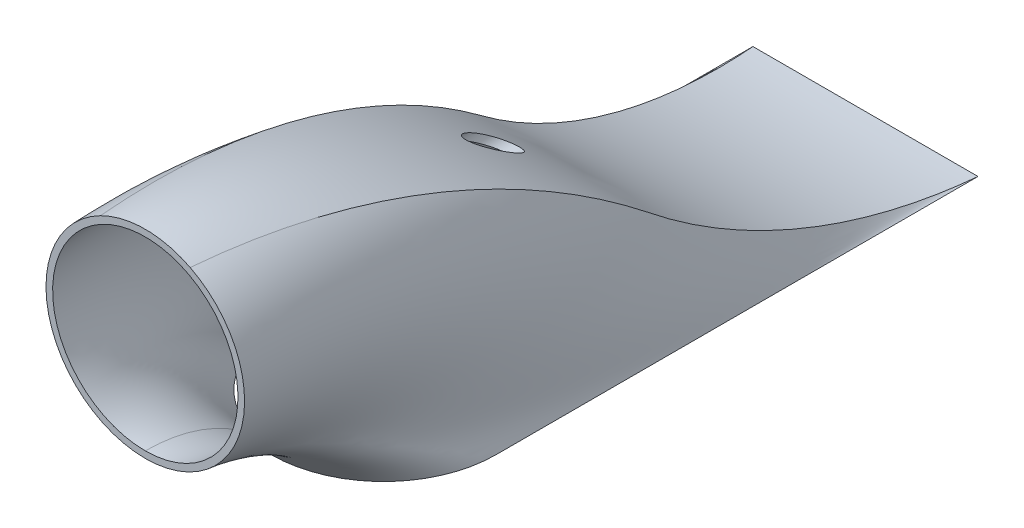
ISO-10303-21;
HEADER;
FILE_DESCRIPTION(('STEP AP214'),'2;1');
FILE_NAME('part.step','',(''),(''),'','','');
FILE_SCHEMA(('AUTOMOTIVE_DESIGN { 1 0 10303 214 1 1 1 1 }'));
ENDSEC;
DATA;
#1=APPLICATION_CONTEXT('core data for automotive mechanical design processes');
#2=APPLICATION_PROTOCOL_DEFINITION('international standard','automotive_design',2000,#1);
#3=PRODUCT_CONTEXT('',#1,'mechanical');
#4=PRODUCT('Part','Part','',(#3));
#5=PRODUCT_RELATED_PRODUCT_CATEGORY('part','',(#4));
#6=PRODUCT_DEFINITION_FORMATION('','',#4);
#7=PRODUCT_DEFINITION_CONTEXT('part definition',#1,'design');
#8=PRODUCT_DEFINITION('design','',#6,#7);
#9=PRODUCT_DEFINITION_SHAPE('','',#8);
#10=(LENGTH_UNIT() NAMED_UNIT(*) SI_UNIT(.MILLI.,.METRE.));
#11=(NAMED_UNIT(*) PLANE_ANGLE_UNIT() SI_UNIT($,.RADIAN.));
#12=(NAMED_UNIT(*) SI_UNIT($,.STERADIAN.) SOLID_ANGLE_UNIT());
#13=UNCERTAINTY_MEASURE_WITH_UNIT(LENGTH_MEASURE(1.E-05),#10,'distance_accuracy_value','');
#14=(GEOMETRIC_REPRESENTATION_CONTEXT(3) GLOBAL_UNCERTAINTY_ASSIGNED_CONTEXT((#13)) GLOBAL_UNIT_ASSIGNED_CONTEXT((#10,
#11,#12)) REPRESENTATION_CONTEXT('',''));
#15=CARTESIAN_POINT('',(0.,0.,0.));
#16=DIRECTION('',(0.,0.,1.));
#17=DIRECTION('',(1.,0.,0.));
#18=AXIS2_PLACEMENT_3D('',#15,#16,#17);
#19=CARTESIAN_POINT('',(0.,0.,-36.));
#20=DIRECTION('',(0.,1.,0.));
#21=DIRECTION('',(0.,0.,1.));
#22=AXIS2_PLACEMENT_3D('',#19,#20,#21);
#23=PLANE('',#22);
#24=CARTESIAN_POINT('',(0.,0.,-36.));
#25=DIRECTION('',(0.,1.,0.));
#26=DIRECTION('',(0.,0.,1.));
#27=AXIS2_PLACEMENT_3D('',#24,#25,#26);
#28=CIRCLE('',#27,16.);
#29=CARTESIAN_POINT('',(-16.,0.,-36.));
#30=VERTEX_POINT('',#29);
#31=CARTESIAN_POINT('',(0.,0.,-20.));
#32=VERTEX_POINT('',#31);
#33=EDGE_CURVE('E584',#30,#32,#28,.T.);
#34=ORIENTED_EDGE('',*,*,#33,.T.);
#35=CARTESIAN_POINT('',(16.,0.,-36.));
#36=VERTEX_POINT('',#35);
#37=EDGE_CURVE('E281',#32,#36,#28,.T.);
#38=ORIENTED_EDGE('',*,*,#37,.T.);
#39=DIRECTION('',(0.,0.,-1.));
#40=VECTOR('',#39,1.);
#41=CARTESIAN_POINT('',(16.,0.,-36.));
#42=LINE('',#41,#40);
#43=CARTESIAN_POINT('',(16.,0.,-98.7978026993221));
#44=VERTEX_POINT('',#43);
#45=EDGE_CURVE('E590',#36,#44,#42,.T.);
#46=ORIENTED_EDGE('',*,*,#45,.T.);
#47=DIRECTION('',(-1.,0.,0.));
#48=VECTOR('',#47,1.);
#49=CARTESIAN_POINT('',(16.,0.,-98.7978026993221));
#50=LINE('',#49,#48);
#51=CARTESIAN_POINT('',(-16.,0.,-98.7978026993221));
#52=VERTEX_POINT('',#51);
#53=EDGE_CURVE('E341',#44,#52,#50,.T.);
#54=ORIENTED_EDGE('',*,*,#53,.T.);
#55=DIRECTION('',(0.,0.,1.));
#56=VECTOR('',#55,1.);
#57=CARTESIAN_POINT('',(-16.,0.,-98.7978026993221));
#58=LINE('',#57,#56);
#59=EDGE_CURVE('E587',#52,#30,#58,.T.);
#60=ORIENTED_EDGE('',*,*,#59,.T.);
#61=EDGE_LOOP('',(#34,#38,#46,#54,#60));
#62=FACE_BOUND('',#61,.T.);
#63=CARTESIAN_POINT('',(0.,0.,-36.));
#64=DIRECTION('',(0.,1.,0.));
#65=DIRECTION('',(0.,0.,1.));
#66=AXIS2_PLACEMENT_3D('',#63,#64,#65);
#67=CIRCLE('',#66,17.);
#68=CARTESIAN_POINT('',(-17.,0.,-36.));
#69=VERTEX_POINT('',#68);
#70=CARTESIAN_POINT('',(0.,0.,-19.));
#71=VERTEX_POINT('',#70);
#72=EDGE_CURVE('E446',#69,#71,#67,.T.);
#73=ORIENTED_EDGE('',*,*,#72,.F.);
#74=DIRECTION('',(0.,0.,1.));
#75=VECTOR('',#74,1.);
#76=CARTESIAN_POINT('',(-17.,0.,-36.));
#77=LINE('',#76,#75);
#78=CARTESIAN_POINT('',(-17.,0.,-108.797802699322));
#79=VERTEX_POINT('',#78);
#80=EDGE_CURVE('E421',#79,#69,#77,.T.);
#81=ORIENTED_EDGE('',*,*,#80,.F.);
#82=DIRECTION('',(-1.,0.,0.));
#83=VECTOR('',#82,1.);
#84=CARTESIAN_POINT('',(-17.,0.,-108.797802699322));
#85=LINE('',#84,#83);
#86=CARTESIAN_POINT('',(17.,0.,-108.797802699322));
#87=VERTEX_POINT('',#86);
#88=EDGE_CURVE('E425',#87,#79,#85,.T.);
#89=ORIENTED_EDGE('',*,*,#88,.F.);
#90=DIRECTION('',(0.,0.,-1.));
#91=VECTOR('',#90,1.);
#92=CARTESIAN_POINT('',(17.,0.,-108.797802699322));
#93=LINE('',#92,#91);
#94=CARTESIAN_POINT('',(17.,0.,-36.));
#95=VERTEX_POINT('',#94);
#96=EDGE_CURVE('E443',#95,#87,#93,.T.);
#97=ORIENTED_EDGE('',*,*,#96,.F.);
#98=EDGE_CURVE('E364',#71,#95,#67,.T.);
#99=ORIENTED_EDGE('',*,*,#98,.F.);
#100=EDGE_LOOP('',(#73,#81,#89,#97,#99));
#101=FACE_BOUND('',#100,.T.);
#102=ADVANCED_FACE('F260',(#62,#101),#23,.F.);
#103=CARTESIAN_POINT('',(0.,24.,0.));
#104=DIRECTION('',(0.,0.,1.));
#105=DIRECTION('',(1.,0.,0.));
#106=AXIS2_PLACEMENT_3D('',#103,#104,#105);
#107=PLANE('',#106);
#108=CARTESIAN_POINT('',(0.,24.,0.));
#109=DIRECTION('',(0.,0.,1.));
#110=DIRECTION('',(1.,0.,0.));
#111=AXIS2_PLACEMENT_3D('',#108,#109,#110);
#112=CIRCLE('',#111,14.);
#113=CARTESIAN_POINT('',(0.,10.,0.));
#114=VERTEX_POINT('',#113);
#115=CARTESIAN_POINT('',(6.65772966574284,36.3156256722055,0.));
#116=VERTEX_POINT('',#115);
#117=EDGE_CURVE('E350',#114,#116,#112,.T.);
#118=ORIENTED_EDGE('',*,*,#117,.F.);
#119=CARTESIAN_POINT('',(-6.65772966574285,36.3156256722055,0.));
#120=VERTEX_POINT('',#119);
#121=EDGE_CURVE('E356',#120,#114,#112,.T.);
#122=ORIENTED_EDGE('',*,*,#121,.F.);
#123=EDGE_CURVE('E337',#116,#120,#112,.T.);
#124=ORIENTED_EDGE('',*,*,#123,.F.);
#125=EDGE_LOOP('',(#118,#122,#124));
#126=FACE_BOUND('',#125,.T.);
#127=CARTESIAN_POINT('',(0.,24.,0.));
#128=DIRECTION('',(0.,0.,1.));
#129=DIRECTION('',(1.,0.,0.));
#130=AXIS2_PLACEMENT_3D('',#127,#128,#129);
#131=CIRCLE('',#130,15.);
#132=CARTESIAN_POINT('',(6.78184265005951,37.3793351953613,0.));
#133=VERTEX_POINT('',#132);
#134=CARTESIAN_POINT('',(-6.78184265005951,37.3793351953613,0.));
#135=VERTEX_POINT('',#134);
#136=EDGE_CURVE('E13',#133,#135,#131,.T.);
#137=ORIENTED_EDGE('',*,*,#136,.T.);
#138=CARTESIAN_POINT('',(0.,9.,0.));
#139=VERTEX_POINT('',#138);
#140=EDGE_CURVE('E273',#135,#139,#131,.T.);
#141=ORIENTED_EDGE('',*,*,#140,.T.);
#142=EDGE_CURVE('E468',#139,#133,#131,.T.);
#143=ORIENTED_EDGE('',*,*,#142,.T.);
#144=EDGE_LOOP('',(#137,#141,#143));
#145=FACE_BOUND('',#144,.T.);
#146=ADVANCED_FACE('F361',(#126,#145),#107,.T.);
#147=CARTESIAN_POINT('',(6.78184265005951,37.3793351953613,0.));
#148=CARTESIAN_POINT('',(8.77070961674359,37.3505804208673,-23.0921174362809));
#149=CARTESIAN_POINT('',(10.7595765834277,29.6796385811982,-45.5020871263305));
#150=CARTESIAN_POINT('',(14.1656290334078,5.69417488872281,-76.4780972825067));
#151=CARTESIAN_POINT('',(15.5828145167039,0.160196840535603,-92.4094788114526));
#152=CARTESIAN_POINT('',(17.,0.,-108.797802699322));
#153=CARTESIAN_POINT('',(7.9017928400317,36.8116443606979,0.));
#154=CARTESIAN_POINT('',(9.67267217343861,36.7772602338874,-22.4739331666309));
#155=CARTESIAN_POINT('',(11.4435515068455,29.2383841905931,-44.2773452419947));
#156=CARTESIAN_POINT('',(14.476287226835,5.67414914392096,-74.3523824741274));
#157=CARTESIAN_POINT('',(15.7381436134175,0.211341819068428,-89.8390564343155));
#158=CARTESIAN_POINT('',(17.,0.,-105.764560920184));
#159=CARTESIAN_POINT('',(10.0022140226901,35.3916192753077,0.));
#160=CARTESIAN_POINT('',(11.3642663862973,35.3499861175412,-21.2272547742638));
#161=CARTESIAN_POINT('',(12.7263187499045,28.1401911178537,-41.8123873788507));
#162=CARTESIAN_POINT('',(15.0589140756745,5.61597007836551,-70.1376177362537));
#163=CARTESIAN_POINT('',(16.0294570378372,0.331634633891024,-84.7256648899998));
#164=CARTESIAN_POINT('',(17.,0.,-99.7083031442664));
#165=CARTESIAN_POINT('',(12.5278213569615,32.536916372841,0.));
#166=CARTESIAN_POINT('',(13.398288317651,32.5058542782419,-19.3323384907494));
#167=CARTESIAN_POINT('',(14.2687552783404,25.9529465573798,-38.0771282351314));
#168=CARTESIAN_POINT('',(15.7594814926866,5.46925168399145,-63.8974375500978));
#169=CARTESIAN_POINT('',(16.3797407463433,0.545339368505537,-77.1154617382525));
#170=CARTESIAN_POINT('',(17.,0.,-90.6430633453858));
#171=CARTESIAN_POINT('',(14.2623808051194,29.1393326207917,0.));
#172=CARTESIAN_POINT('',(14.795232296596,29.1394793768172,-17.4185543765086));
#173=CARTESIAN_POINT('',(15.3280837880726,23.3649195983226,-34.312646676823));
#174=CARTESIAN_POINT('',(16.2406235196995,5.27258457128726,-57.7111965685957));
#175=CARTESIAN_POINT('',(16.6203117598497,0.778850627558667,-69.5426672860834));
#176=CARTESIAN_POINT('',(17.,0.,-81.5854399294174));
#177=CARTESIAN_POINT('',(15.0932751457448,25.4178654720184,0.));
#178=CARTESIAN_POINT('',(15.464400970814,25.4618088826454,-15.4919742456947));
#179=CARTESIAN_POINT('',(15.8355267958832,20.5380094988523,-30.5276245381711));
#180=CARTESIAN_POINT('',(16.4711017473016,5.04579218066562,-51.5510191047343));
#181=CARTESIAN_POINT('',(16.7355508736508,1.02387060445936,-61.984987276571));
#182=CARTESIAN_POINT('',(17.,0.,-72.5241128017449));
#183=CARTESIAN_POINT('',(14.9699365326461,21.6134626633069,0.));
#184=CARTESIAN_POINT('',(15.3650690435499,21.7014681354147,-13.5586699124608));
#185=CARTESIAN_POINT('',(15.7602015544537,17.6475209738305,-26.7307436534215));
#186=CARTESIAN_POINT('',(16.436889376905,4.8147866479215,-45.3890294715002));
#187=CARTESIAN_POINT('',(16.7184446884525,1.27514584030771,-54.4201274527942));
#188=CARTESIAN_POINT('',(17.,0.,-63.4477618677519));
#189=CARTESIAN_POINT('',(13.9070159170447,17.9706091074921,0.));
#190=CARTESIAN_POINT('',(14.5090357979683,18.089931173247,-11.624642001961));
#191=CARTESIAN_POINT('',(15.1110556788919,14.8709189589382,-22.9305434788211));
#192=CARTESIAN_POINT('',(16.1420503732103,4.60646127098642,-39.1970876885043));
#193=CARTESIAN_POINT('',(16.5710251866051,1.5279134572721,-46.8254785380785));
#194=CARTESIAN_POINT('',(17.,0.,-54.3447012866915));
#195=CARTESIAN_POINT('',(11.982367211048,14.7189847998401,0.));
#196=CARTESIAN_POINT('',(12.9590016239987,14.8467487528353,-9.69589113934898));
#197=CARTESIAN_POINT('',(13.9356360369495,12.3766267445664,-19.1355634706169));
#198=CARTESIAN_POINT('',(15.6081802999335,4.44360267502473,-32.9470537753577));
#199=CARTESIAN_POINT('',(16.3040901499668,1.77535724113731,-39.1784312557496));
#200=CARTESIAN_POINT('',(17.,0.,-45.2032452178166));
#201=CARTESIAN_POINT('',(10.2138001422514,12.9450070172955,0.));
#202=CARTESIAN_POINT('',(11.5346692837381,13.060321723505,-8.41743813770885));
#203=CARTESIAN_POINT('',(12.8555384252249,11.0019371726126,-16.6144747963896));
#204=CARTESIAN_POINT('',(15.1176050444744,4.37493830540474,-28.7223657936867));
#205=CARTESIAN_POINT('',(16.0588025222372,1.92942927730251,-34.029785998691));
#206=CARTESIAN_POINT('',(17.,0.,-39.0748469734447));
#207=CARTESIAN_POINT('',(8.55789298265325,11.6506183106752,0.));
#208=CARTESIAN_POINT('',(10.2010686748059,11.749015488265,-7.33766528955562));
#209=CARTESIAN_POINT('',(11.8442443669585,9.9925116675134,-14.4818476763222));
#210=CARTESIAN_POINT('',(14.6582800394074,4.33410919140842,-25.1056879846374));
#211=CARTESIAN_POINT('',(15.8291400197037,2.05061024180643,-29.6339480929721));
#212=CARTESIAN_POINT('',(17.,0.,-33.8579156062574));
#213=CARTESIAN_POINT('',(7.13538594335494,10.7269540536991,0.));
#214=CARTESIAN_POINT('',(8.8955423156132,10.8041514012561,-6.43982091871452));
#215=CARTESIAN_POINT('',(10.6556986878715,9.26476243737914,-12.7062816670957));
#216=CARTESIAN_POINT('',(13.6700707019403,4.31577721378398,-22.0654555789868));
#217=CARTESIAN_POINT('',(14.9242863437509,2.14729267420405,-25.9466539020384));
#218=CARTESIAN_POINT('',(16.1785019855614,0.,-29.4922127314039));
#219=CARTESIAN_POINT('',(4.85790128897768,9.73733582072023,0.));
#220=CARTESIAN_POINT('',(6.33473257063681,9.77678488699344,-5.26925868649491));
#221=CARTESIAN_POINT('',(7.81156385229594,8.47280649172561,-10.3882220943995));
#222=CARTESIAN_POINT('',(10.3407248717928,4.31393104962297,-18.0555916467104));
#223=CARTESIAN_POINT('',(11.3930546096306,2.26769418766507,-21.0943340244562));
#224=CARTESIAN_POINT('',(12.4453843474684,0.,-23.7615067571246));
#225=CARTESIAN_POINT('',(2.86950675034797,9.23723641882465,0.));
#226=CARTESIAN_POINT('',(3.80503143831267,9.25104777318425,-4.61189944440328));
#227=CARTESIAN_POINT('',(4.74055612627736,8.06725196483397,-9.08581633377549));
#228=CARTESIAN_POINT('',(6.34269755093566,4.32076450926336,-15.7944293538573));
#229=CARTESIAN_POINT('',(7.00931428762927,2.33587758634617,-18.3603009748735));
#230=CARTESIAN_POINT('',(7.67593102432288,0.,-20.5354223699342));
#231=CARTESIAN_POINT('',(1.2399597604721,9.03430413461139,0.));
#232=CARTESIAN_POINT('',(1.65034080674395,9.03647508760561,-4.34373948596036));
#233=CARTESIAN_POINT('',(2.06072185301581,7.90167721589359,-8.55461657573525));
#234=CARTESIAN_POINT('',(2.7635236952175,4.32500154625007,-14.8734397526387));
#235=CARTESIAN_POINT('',(3.05594449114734,2.36492886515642,-17.2463754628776));
#236=CARTESIAN_POINT('',(3.34836528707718,0.,-19.2205848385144));
#237=CARTESIAN_POINT('',(0.414668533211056,9.,0.));
#238=CARTESIAN_POINT('',(0.550523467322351,9.,-4.2986871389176));
#239=CARTESIAN_POINT('',(0.686378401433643,7.8735226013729,-8.46539775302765));
#240=CARTESIAN_POINT('',(0.919038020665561,4.32595832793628,-14.7190820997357));
#241=CARTESIAN_POINT('',(1.01584270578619,2.37006706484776,-17.0595942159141));
#242=CARTESIAN_POINT('',(1.11264739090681,0.,-19.));
#243=CARTESIAN_POINT('',(0.,9.,0.));
#244=CARTESIAN_POINT('',(0.,9.,-4.2986871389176));
#245=CARTESIAN_POINT('',(0.,7.8735226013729,-8.46539775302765));
#246=CARTESIAN_POINT('',(0.,4.32595832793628,-14.7190820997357));
#247=CARTESIAN_POINT('',(0.,2.37006706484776,-17.0595942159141));
#248=CARTESIAN_POINT('',(0.,0.,-19.));
#249=B_SPLINE_SURFACE_WITH_KNOTS('',3,3,((#147,#148,#149,#150,#151,#152),(#153,#154,#155,#156,
#157,#158),(#159,#160,#161,#162,#163,#164),(#165,#166,#167,#168,#169,#170),(#171,#172,#173,#174,
#175,#176),(#177,#178,#179,#180,#181,#182),(#183,#184,#185,#186,#187,#188),(#189,#190,#191,#192,
#193,#194),(#195,#196,#197,#198,#199,#200),(#201,#202,#203,#204,#205,#206),(#207,#208,#209,#210,
#211,#212),(#213,#214,#215,#216,#217,#218),(#219,#220,#221,#222,#223,#224),(#225,#226,#227,#228,
#229,#230),(#231,#232,#233,#234,#235,#236),(#237,#238,#239,#240,#241,#242),(#243,#244,#245,#246,
#247,#248)),.UNSPECIFIED.,.F.,.F.,.F.,(4,1,1,1,1,1,1,1,2,1,1,1,1,4),(4,2,4),(0.573813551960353,
0.613324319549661,0.65283508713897,0.692345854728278,0.731856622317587,0.771367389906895,
0.810878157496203,0.850388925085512,0.88989969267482,0.917424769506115,0.94494984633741,
0.972474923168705,0.986237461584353,1.),(0.,0.583921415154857,1.),.UNSPECIFIED.);
#250=CARTESIAN_POINT('',(0.,9.,0.));
#251=CARTESIAN_POINT('',(0.,9.,-4.2986871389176));
#252=CARTESIAN_POINT('',(0.,7.8735226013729,-8.46539775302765));
#253=CARTESIAN_POINT('',(0.,4.32595832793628,-14.7190820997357));
#254=CARTESIAN_POINT('',(0.,2.37006706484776,-17.0595942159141));
#255=CARTESIAN_POINT('',(0.,0.,-19.));
#256=B_SPLINE_CURVE_WITH_KNOTS('',3,(#250,#251,#252,#253,#254,#255),.UNSPECIFIED.,.F.,.F.,(4,2,
4),(0.,0.583921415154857,1.),.UNSPECIFIED.);
#257=EDGE_CURVE('E471',#139,#71,#256,.T.);
#258=CARTESIAN_POINT('',(6.78184265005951,37.3793351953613,0.));
#259=CARTESIAN_POINT('',(8.77070961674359,37.3505804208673,-23.0921174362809));
#260=CARTESIAN_POINT('',(10.7595765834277,29.6796385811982,-45.5020871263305));
#261=CARTESIAN_POINT('',(14.1656290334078,5.69417488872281,-76.4780972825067));
#262=CARTESIAN_POINT('',(15.5828145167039,0.160196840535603,-92.4094788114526));
#263=CARTESIAN_POINT('',(17.,0.,-108.797802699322));
#264=B_SPLINE_CURVE_WITH_KNOTS('',3,(#258,#259,#260,#261,#262,#263),.UNSPECIFIED.,.F.,.F.,(4,2,
4),(0.,0.583921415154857,1.),.UNSPECIFIED.);
#265=EDGE_CURVE('E492',#133,#87,#264,.T.);
#266=ORIENTED_EDGE('',*,*,#142,.F.);
#267=ORIENTED_EDGE('',*,*,#257,.T.);
#268=ORIENTED_EDGE('',*,*,#98,.T.);
#269=ORIENTED_EDGE('',*,*,#96,.T.);
#270=ORIENTED_EDGE('',*,*,#265,.F.);
#271=EDGE_LOOP('',(#266,#267,#268,#269,#270));
#272=FACE_BOUND('',#271,.T.);
#273=ADVANCED_FACE('F383',(#272),#249,.T.);
#274=CARTESIAN_POINT('',(-6.78184265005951,37.3793351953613,0.));
#275=CARTESIAN_POINT('',(-8.77070961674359,37.3505804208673,-23.0921174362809));
#276=CARTESIAN_POINT('',(-10.7595765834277,29.6796385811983,-45.5020871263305));
#277=CARTESIAN_POINT('',(-14.1656290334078,5.69417488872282,-76.4780972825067));
#278=CARTESIAN_POINT('',(-15.5828145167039,0.160196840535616,-92.4094788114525));
#279=CARTESIAN_POINT('',(-17.,0.,-108.797802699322));
#280=CARTESIAN_POINT('',(-6.25877321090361,37.6444735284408,0.));
#281=CARTESIAN_POINT('',(-8.07370999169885,37.6183479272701,-23.1050979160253));
#282=CARTESIAN_POINT('',(-9.88864677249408,29.8857251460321,-45.5226178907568));
#283=CARTESIAN_POINT('',(-12.9968334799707,5.70352785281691,-76.4472025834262));
#284=CARTESIAN_POINT('',(-14.290083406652,0.136309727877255,-92.3898019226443));
#285=CARTESIAN_POINT('',(-15.5833333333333,0.,-108.797802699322));
#286=CARTESIAN_POINT('',(-5.18150645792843,38.1133374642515,0.));
#287=CARTESIAN_POINT('',(-6.65464161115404,38.0932130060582,-23.1283757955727));
#288=CARTESIAN_POINT('',(-8.12777676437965,30.2512641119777,-45.5594356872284));
#289=CARTESIAN_POINT('',(-10.6506079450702,5.71846745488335,-76.3917991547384));
#290=CARTESIAN_POINT('',(-11.7003039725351,0.092556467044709,-92.3545153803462));
#291=CARTESIAN_POINT('',(-12.75,0.,-108.797802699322));
#292=CARTESIAN_POINT('',(-3.49440270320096,38.6226963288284,0.));
#293=CARTESIAN_POINT('',(-4.46869452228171,38.612167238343,-23.1544003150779));
#294=CARTESIAN_POINT('',(-5.44298634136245,30.6508785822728,-45.6005977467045));
#295=CARTESIAN_POINT('',(-7.1115187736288,5.73105675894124,-76.3298584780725));
#296=CARTESIAN_POINT('',(-7.80575938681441,0.0415840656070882,-92.3150652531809));
#297=CARTESIAN_POINT('',(-8.50000000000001,0.,-108.797802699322));
#298=CARTESIAN_POINT('',(-1.75928814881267,38.9311489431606,0.));
#299=CARTESIAN_POINT('',(-2.24408147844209,38.9286428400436,-23.1706894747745));
#300=CARTESIAN_POINT('',(-2.72887480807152,30.8946746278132,-45.6263617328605));
#301=CARTESIAN_POINT('',(-3.55911209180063,5.73606200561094,-76.2910888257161));
#302=CARTESIAN_POINT('',(-3.90455604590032,0.0082423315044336,-92.2903727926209));
#303=CARTESIAN_POINT('',(-4.25,0.,-108.797802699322));
#304=CARTESIAN_POINT('',(-0.586429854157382,39.,0.));
#305=CARTESIAN_POINT('',(-0.748027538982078,39.,-23.1744966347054));
#306=CARTESIAN_POINT('',(-0.909625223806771,30.9496758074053,-45.6323833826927));
#307=CARTESIAN_POINT('',(-1.18637082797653,5.73633268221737,-76.2820274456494));
#308=CARTESIAN_POINT('',(-1.3015187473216,0.,-92.2846015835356));
#309=CARTESIAN_POINT('',(-1.41666666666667,0.,-108.797802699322));
#310=CARTESIAN_POINT('',(0.586429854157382,39.,0.));
#311=CARTESIAN_POINT('',(0.748027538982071,39.,-23.1744966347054));
#312=CARTESIAN_POINT('',(0.909625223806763,30.9496758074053,-45.6323833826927));
#313=CARTESIAN_POINT('',(1.18637082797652,5.73633268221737,-76.2820274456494));
#314=CARTESIAN_POINT('',(1.30151874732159,0.,-92.2846015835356));
#315=CARTESIAN_POINT('',(1.41666666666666,0.,-108.797802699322));
#316=CARTESIAN_POINT('',(1.75928814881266,38.9311489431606,0.));
#317=CARTESIAN_POINT('',(2.24408147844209,38.9286428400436,-23.1706894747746));
#318=CARTESIAN_POINT('',(2.72887480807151,30.8946746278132,-45.6263617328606));
#319=CARTESIAN_POINT('',(3.55911209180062,5.73606200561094,-76.2910888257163));
#320=CARTESIAN_POINT('',(3.90455604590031,0.00824233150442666,-92.2903727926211));
#321=CARTESIAN_POINT('',(4.24999999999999,0.,-108.797802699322));
#322=CARTESIAN_POINT('',(3.49440270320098,38.6226963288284,0.));
#323=CARTESIAN_POINT('',(4.46869452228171,38.612167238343,-23.1544003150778));
#324=CARTESIAN_POINT('',(5.44298634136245,30.6508785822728,-45.6005977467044));
#325=CARTESIAN_POINT('',(7.11151877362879,5.73105675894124,-76.3298584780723));
#326=CARTESIAN_POINT('',(7.80575938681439,0.041584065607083,-92.3150652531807));
#327=CARTESIAN_POINT('',(8.5,0.,-108.797802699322));
#328=CARTESIAN_POINT('',(5.18150645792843,38.1133374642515,0.));
#329=CARTESIAN_POINT('',(6.65464161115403,38.0932130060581,-23.1283757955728));
#330=CARTESIAN_POINT('',(8.12777676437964,30.2512641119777,-45.5594356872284));
#331=CARTESIAN_POINT('',(10.6506079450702,5.71846745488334,-76.3917991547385));
#332=CARTESIAN_POINT('',(11.7003039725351,0.0925564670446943,-92.3545153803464));
#333=CARTESIAN_POINT('',(12.75,0.,-108.797802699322));
#334=CARTESIAN_POINT('',(6.25877321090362,37.6444735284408,0.));
#335=CARTESIAN_POINT('',(8.07370999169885,37.6183479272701,-23.1050979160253));
#336=CARTESIAN_POINT('',(9.88864677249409,29.885725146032,-45.5226178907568));
#337=CARTESIAN_POINT('',(12.9968334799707,5.7035278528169,-76.4472025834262));
#338=CARTESIAN_POINT('',(14.290083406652,0.136309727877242,-92.3898019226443));
#339=CARTESIAN_POINT('',(15.5833333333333,0.,-108.797802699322));
#340=CARTESIAN_POINT('',(6.78184265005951,37.3793351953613,0.));
#341=CARTESIAN_POINT('',(8.77070961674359,37.3505804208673,-23.0921174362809));
#342=CARTESIAN_POINT('',(10.7595765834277,29.6796385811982,-45.5020871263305));
#343=CARTESIAN_POINT('',(14.1656290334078,5.69417488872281,-76.4780972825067));
#344=CARTESIAN_POINT('',(15.5828145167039,0.160196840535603,-92.4094788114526));
#345=CARTESIAN_POINT('',(17.,0.,-108.797802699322));
#346=B_SPLINE_SURFACE_WITH_KNOTS('',3,3,((#274,#275,#276,#277,#278,#279),(#280,#281,#282,#283,
#284,#285),(#286,#287,#288,#289,#290,#291),(#292,#293,#294,#295,#296,#297),(#298,#299,#300,#301,
#302,#303),(#304,#305,#306,#307,#308,#309),(#310,#311,#312,#313,#314,#315),(#316,#317,#318,#319,
#320,#321),(#322,#323,#324,#325,#326,#327),(#328,#329,#330,#331,#332,#333),(#334,#335,#336,#337,
#338,#339),(#340,#341,#342,#343,#344,#345)),.UNSPECIFIED.,.F.,.F.,.F.,(4,1,1,1,2,1,1,1,4),(4,2,
4),(0.426186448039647,0.444639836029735,0.463093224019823,0.481546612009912,0.5,
0.518453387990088,0.536906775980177,0.555360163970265,0.573813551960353),(0.,0.583921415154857,
1.),.UNSPECIFIED.);
#347=CARTESIAN_POINT('',(2.5,24.,-52.6070712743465));
#348=CARTESIAN_POINT('',(2.50000234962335,23.8888780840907,-52.7873893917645));
#349=CARTESIAN_POINT('',(2.49261257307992,23.7773557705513,-52.9674929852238));
#350=CARTESIAN_POINT('',(2.4624831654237,23.5540440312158,-53.3263563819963));
#351=CARTESIAN_POINT('',(2.43973756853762,23.4422545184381,-53.5051156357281));
#352=CARTESIAN_POINT('',(2.37780540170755,23.219358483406,-53.8597526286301));
#353=CARTESIAN_POINT('',(2.33865037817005,23.1082510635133,-54.0356352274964));
#354=CARTESIAN_POINT('',(2.24205326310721,22.8874649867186,-54.3833685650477));
#355=CARTESIAN_POINT('',(2.18461090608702,22.7777863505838,-54.5552192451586));
#356=CARTESIAN_POINT('',(2.0628078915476,22.5840046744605,-54.8573214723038));
#357=CARTESIAN_POINT('',(2.00237693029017,22.4993306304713,-54.9887853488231));
#358=CARTESIAN_POINT('',(1.86636213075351,22.3332006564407,-55.2457070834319));
#359=CARTESIAN_POINT('',(1.79079902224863,22.2517405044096,-55.371172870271));
#360=CARTESIAN_POINT('',(1.66366197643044,22.1330160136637,-55.553354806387));
#361=CARTESIAN_POINT('',(1.61867431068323,22.093795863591,-55.6134185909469));
#362=CARTESIAN_POINT('',(1.52375375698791,22.0170980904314,-55.7306625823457));
#363=CARTESIAN_POINT('',(1.47382316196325,21.9796196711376,-55.7878441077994));
#364=CARTESIAN_POINT('',(1.3686969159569,21.9069778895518,-55.8984825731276));
#365=CARTESIAN_POINT('',(1.31351292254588,21.8718096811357,-55.9519473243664));
#366=CARTESIAN_POINT('',(1.19742720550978,21.8043980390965,-56.054266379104));
#367=CARTESIAN_POINT('',(1.13652985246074,21.7721524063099,-56.103124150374));
#368=CARTESIAN_POINT('',(1.0001190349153,21.7073584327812,-56.2011582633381));
#369=CARTESIAN_POINT('',(0.923740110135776,21.6753466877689,-56.2495028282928));
#370=CARTESIAN_POINT('',(0.763148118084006,21.6178063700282,-56.33628834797));
#371=CARTESIAN_POINT('',(0.678938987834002,21.5922745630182,-56.3747342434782));
#372=CARTESIAN_POINT('',(0.547079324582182,21.5601651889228,-56.4230418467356));
#373=CARTESIAN_POINT('',(0.501891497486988,21.5504512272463,-56.4376474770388));
#374=CARTESIAN_POINT('',(0.410074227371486,21.53342036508,-56.4632451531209));
#375=CARTESIAN_POINT('',(0.363445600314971,21.5261021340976,-56.4742392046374));
#376=CARTESIAN_POINT('',(0.269143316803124,21.5140761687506,-56.4923013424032));
#377=CARTESIAN_POINT('',(0.221470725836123,21.5093658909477,-56.4993732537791));
#378=CARTESIAN_POINT('',(0.125520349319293,21.5026889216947,-56.509396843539));
#379=CARTESIAN_POINT('',(0.0772426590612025,21.5007218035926,-56.5123491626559));
#380=CARTESIAN_POINT('',(-0.0542402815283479,21.4992129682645,-56.5146141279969));
#381=CARTESIAN_POINT('',(-0.137601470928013,21.5024319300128,-56.5097837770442));
#382=CARTESIAN_POINT('',(-0.301955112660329,21.5169265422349,-56.4880212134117));
#383=CARTESIAN_POINT('',(-0.382946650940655,21.5282052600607,-56.4710843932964));
#384=CARTESIAN_POINT('',(-0.537631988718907,21.5572710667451,-56.4273962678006));
#385=CARTESIAN_POINT('',(-0.611484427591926,21.5748046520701,-56.4010271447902));
#386=CARTESIAN_POINT('',(-0.754180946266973,21.6153140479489,-56.3400330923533));
#387=CARTESIAN_POINT('',(-0.8230172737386,21.6382980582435,-56.3053957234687));
#388=CARTESIAN_POINT('',(-0.944219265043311,21.6844152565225,-56.2358003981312));
#389=CARTESIAN_POINT('',(-0.997424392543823,21.7068930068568,-56.2018460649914));
#390=CARTESIAN_POINT('',(-1.09997788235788,21.7542851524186,-56.1301676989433));
#391=CARTESIAN_POINT('',(-1.14932906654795,21.7791977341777,-56.0924464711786));
#392=CARTESIAN_POINT('',(-1.29214285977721,21.8570659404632,-55.9743836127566));
#393=CARTESIAN_POINT('',(-1.38008430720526,21.9130396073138,-55.8893122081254));
#394=CARTESIAN_POINT('',(-1.52894321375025,22.0202855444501,-55.7258189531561));
#395=CARTESIAN_POINT('',(-1.59191807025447,22.0707646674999,-55.6486859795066));
#396=CARTESIAN_POINT('',(-1.70971493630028,22.1743425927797,-55.4900059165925));
#397=CARTESIAN_POINT('',(-1.76453218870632,22.227442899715,-55.4084562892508));
#398=CARTESIAN_POINT('',(-1.86686503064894,22.3355592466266,-55.2419720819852));
#399=CARTESIAN_POINT('',(-1.91437131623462,22.3905776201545,-55.1570333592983));
#400=CARTESIAN_POINT('',(-2.00273422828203,22.5019661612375,-54.9846040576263));
#401=CARTESIAN_POINT('',(-2.04358859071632,22.5583367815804,-54.8971126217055));
#402=CARTESIAN_POINT('',(-2.14765786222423,22.7147404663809,-54.6536994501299));
#403=CARTESIAN_POINT('',(-2.20462379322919,22.8157711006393,-54.4957315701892));
#404=CARTESIAN_POINT('',(-2.30242521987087,23.0193942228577,-54.1758240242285));
#405=CARTESIAN_POINT('',(-2.34324915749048,23.1219877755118,-54.0138816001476));
#406=CARTESIAN_POINT('',(-2.41043888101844,23.3280283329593,-53.6871098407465));
#407=CARTESIAN_POINT('',(-2.43677474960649,23.4314766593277,-53.5222752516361));
#408=CARTESIAN_POINT('',(-2.47594462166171,23.6383683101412,-53.1910833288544));
#409=CARTESIAN_POINT('',(-2.48878122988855,23.7418116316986,-53.0247262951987));
#410=CARTESIAN_POINT('',(-2.50205589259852,23.9555360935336,-52.679463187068));
#411=CARTESIAN_POINT('',(-2.50155427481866,24.0657841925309,-52.5005006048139));
#412=CARTESIAN_POINT('',(-2.48610767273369,24.2852546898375,-52.1425773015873));
#413=CARTESIAN_POINT('',(-2.47116283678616,24.3944770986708,-51.9636165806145));
#414=CARTESIAN_POINT('',(-2.42669376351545,24.611008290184,-51.6072422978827));
#415=CARTESIAN_POINT('',(-2.39722349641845,24.7183226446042,-51.4298254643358));
#416=CARTESIAN_POINT('',(-2.32294640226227,24.9309184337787,-51.0768605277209));
#417=CARTESIAN_POINT('',(-2.27813257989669,25.0361989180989,-50.9013133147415));
#418=CARTESIAN_POINT('',(-2.17142286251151,25.2444713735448,-50.5526423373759));
#419=CARTESIAN_POINT('',(-2.10944034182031,25.3474487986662,-50.379535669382));
#420=CARTESIAN_POINT('',(-2.00189984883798,25.4987336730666,-50.1242731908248));
#421=CARTESIAN_POINT('',(-1.96364104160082,25.5486149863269,-50.0399471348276));
#422=CARTESIAN_POINT('',(-1.88180181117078,25.6470960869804,-49.8731621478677));
#423=CARTESIAN_POINT('',(-1.83822283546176,25.6956962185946,-49.7907027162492));
#424=CARTESIAN_POINT('',(-1.74445497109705,25.7920567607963,-49.626929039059));
#425=CARTESIAN_POINT('',(-1.69417355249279,25.8397922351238,-49.5456527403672));
#426=CARTESIAN_POINT('',(-1.58680375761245,25.9331625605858,-49.3864176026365));
#427=CARTESIAN_POINT('',(-1.52971555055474,25.9787974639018,-49.3084586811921));
#428=CARTESIAN_POINT('',(-1.40818975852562,26.0670290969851,-49.1575043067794));
#429=CARTESIAN_POINT('',(-1.3437973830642,26.1096421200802,-49.0844823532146));
#430=CARTESIAN_POINT('',(-1.20633571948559,26.1911509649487,-48.9446206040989));
#431=CARTESIAN_POINT('',(-1.13326508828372,26.2300462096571,-48.8777817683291));
#432=CARTESIAN_POINT('',(-0.990764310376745,26.2964003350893,-48.7636262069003));
#433=CARTESIAN_POINT('',(-0.922841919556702,26.3246780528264,-48.7149246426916));
#434=CARTESIAN_POINT('',(-0.780167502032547,26.3763600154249,-48.6258448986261));
#435=CARTESIAN_POINT('',(-0.705431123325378,26.399775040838,-48.5854483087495));
#436=CARTESIAN_POINT('',(-0.548144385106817,26.4405295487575,-48.5150971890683));
#437=CARTESIAN_POINT('',(-0.46550282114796,26.4577835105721,-48.4852896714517));
#438=CARTESIAN_POINT('',(-0.337849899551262,26.4774425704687,-48.4513168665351));
#439=CARTESIAN_POINT('',(-0.294697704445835,26.482957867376,-48.4417836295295));
#440=CARTESIAN_POINT('',(-0.207483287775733,26.4917596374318,-48.4265681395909));
#441=CARTESIAN_POINT('',(-0.163421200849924,26.4950464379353,-48.4208853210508));
#442=CARTESIAN_POINT('',(-0.0797987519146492,26.4990368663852,-48.4139857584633));
#443=CARTESIAN_POINT('',(-0.0402847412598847,26.4999878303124,-48.4123413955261));
#444=CARTESIAN_POINT('',(0.0387607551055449,26.5000119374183,-48.412299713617));
#445=CARTESIAN_POINT('',(0.0782922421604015,26.4990844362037,-48.4139035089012));
#446=CARTESIAN_POINT('',(0.157002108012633,26.4953761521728,-48.4203152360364));
#447=CARTESIAN_POINT('',(0.196180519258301,26.4925955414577,-48.4251228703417));
#448=CARTESIAN_POINT('',(0.273875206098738,26.4852601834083,-48.4378038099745));
#449=CARTESIAN_POINT('',(0.312391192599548,26.4807046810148,-48.4456784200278));
#450=CARTESIAN_POINT('',(0.419298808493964,26.4655652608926,-48.4718432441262));
#451=CARTESIAN_POINT('',(0.486646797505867,26.4530860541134,-48.4934055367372));
#452=CARTESIAN_POINT('',(0.617131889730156,26.4235595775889,-48.5443948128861));
#453=CARTESIAN_POINT('',(0.680268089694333,26.4065113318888,-48.5738234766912));
#454=CARTESIAN_POINT('',(0.843154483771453,26.3559502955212,-48.6610415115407));
#455=CARTESIAN_POINT('',(0.938801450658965,26.3190984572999,-48.7245539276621));
#456=CARTESIAN_POINT('',(1.11782699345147,26.2383437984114,-48.8635231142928));
#457=CARTESIAN_POINT('',(1.20115344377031,26.1944125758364,-48.9390279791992));
#458=CARTESIAN_POINT('',(1.34658800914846,26.1078145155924,-49.0876146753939));
#459=CARTESIAN_POINT('',(1.4100462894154,26.0657257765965,-49.1597354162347));
#460=CARTESIAN_POINT('',(1.52944091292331,25.9789515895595,-49.3081936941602));
#461=CARTESIAN_POINT('',(1.58539004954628,25.9342707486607,-49.3845237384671));
#462=CARTESIAN_POINT('',(1.69091170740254,25.842744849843,-49.5406210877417));
#463=CARTESIAN_POINT('',(1.74046399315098,25.7958935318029,-49.6203982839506));
#464=CARTESIAN_POINT('',(1.8337053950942,25.7005780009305,-49.7824145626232));
#465=CARTESIAN_POINT('',(1.8773915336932,25.6521129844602,-49.8646548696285));
#466=CARTESIAN_POINT('',(1.99477963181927,25.5116436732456,-50.1025792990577));
#467=CARTESIAN_POINT('',(2.06196177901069,25.4180607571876,-50.2605652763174));
#468=CARTESIAN_POINT('',(2.180599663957,25.2278176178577,-50.5805505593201));
#469=CARTESIAN_POINT('',(2.23204475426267,25.1311553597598,-50.7425525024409));
#470=CARTESIAN_POINT('',(2.32077743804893,24.9356804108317,-51.0688903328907));
#471=CARTESIAN_POINT('',(2.35807678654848,24.8368695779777,-51.2332241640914));
#472=CARTESIAN_POINT('',(2.41956192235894,24.6376365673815,-51.5632285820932));
#473=CARTESIAN_POINT('',(2.44375426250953,24.5372152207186,-51.7288984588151));
#474=CARTESIAN_POINT('',(2.47443793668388,24.3640339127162,-52.0134011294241));
#475=CARTESIAN_POINT('',(2.48401184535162,24.2915685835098,-52.1320915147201));
#476=CARTESIAN_POINT('',(2.49679358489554,24.1461268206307,-52.3695759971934));
#477=CARTESIAN_POINT('',(2.49999845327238,24.0731501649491,-52.4883701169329));
#478=CARTESIAN_POINT('',(2.5,24.,-52.6070712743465));
#479=B_SPLINE_CURVE_WITH_KNOTS('',3,(#347,#348,#349,#350,#351,#352,#353,#354,#355,#356,#357,
#358,#359,#360,#361,#362,#363,#364,#365,#366,#367,#368,#369,#370,#371,#372,#373,#374,#375,#376,
#377,#378,#379,#380,#381,#382,#383,#384,#385,#386,#387,#388,#389,#390,#391,#392,#393,#394,#395,
#396,#397,#398,#399,#400,#401,#402,#403,#404,#405,#406,#407,#408,#409,#410,#411,#412,#413,#414,
#415,#416,#417,#418,#419,#420,#421,#422,#423,#424,#425,#426,#427,#428,#429,#430,#431,#432,#433,
#434,#435,#436,#437,#438,#439,#440,#441,#442,#443,#444,#445,#446,#447,#448,#449,#450,#451,#452,
#453,#454,#455,#456,#457,#458,#459,#460,#461,#462,#463,#464,#465,#466,#467,#468,#469,#470,#471,
#472,#473,#474,#475,#476,#477,#478),.UNSPECIFIED.,.T.,.F.,(4,2,2,2,2,2,2,2,2,2,2,2,2,2,2,2,2,2,
2,2,2,2,2,2,2,2,2,2,2,2,2,2,2,2,2,2,2,2,2,2,2,2,2,2,2,2,2,2,2,2,2,2,2,2,2,2,2,2,2,2,2,2,2,2,2,
4),(0.,0.635334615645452,1.27091620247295,1.90528147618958,2.53965596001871,3.0419672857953,
3.54359513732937,3.79745048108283,4.05118861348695,4.30437625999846,4.5573717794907,
4.84421270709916,5.13091018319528,5.27614775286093,5.42130452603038,5.56631948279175,
5.71131188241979,5.96055084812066,6.20988471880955,6.45008655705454,6.69065207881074,
6.89136646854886,7.0919324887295,7.49409362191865,7.82860107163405,8.16330283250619,
8.49842707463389,8.83366514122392,9.42066568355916,10.0080857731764,10.5967143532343,
11.1852293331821,11.8153080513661,12.445380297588,13.0731289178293,13.7011641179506,
14.3324277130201,14.647840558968,14.9631677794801,15.2834153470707,15.6036549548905,
15.9220107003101,16.2404157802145,16.5044688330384,16.7679300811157,17.0349179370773,
17.1683296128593,17.3017216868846,17.4202279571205,17.5387748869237,17.657310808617,
17.7758972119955,17.9904384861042,18.2050256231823,18.5646849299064,18.9258248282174,
19.2400154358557,19.5536637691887,19.8682811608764,20.1830576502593,20.7687033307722,
21.3547443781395,21.9402973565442,22.5255573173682,22.943595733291,23.3618285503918),.UNSPECIFIED.);
#480=CARTESIAN_POINT('',(2.5,24.,-52.6070712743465));
#481=VERTEX_POINT('',#480);
#482=EDGE_CURVE('E638',#481,#481,#479,.T.);
#483=CARTESIAN_POINT('',(-6.78184265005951,37.3793351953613,0.));
#484=CARTESIAN_POINT('',(-8.77070961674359,37.3505804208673,-23.0921174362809));
#485=CARTESIAN_POINT('',(-10.7595765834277,29.6796385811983,-45.5020871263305));
#486=CARTESIAN_POINT('',(-14.1656290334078,5.69417488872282,-76.4780972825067));
#487=CARTESIAN_POINT('',(-15.5828145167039,0.160196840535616,-92.4094788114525));
#488=CARTESIAN_POINT('',(-17.,0.,-108.797802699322));
#489=B_SPLINE_CURVE_WITH_KNOTS('',3,(#483,#484,#485,#486,#487,#488),.UNSPECIFIED.,.F.,.F.,(4,2,
4),(0.,0.583921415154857,1.),.UNSPECIFIED.);
#490=EDGE_CURVE('E424',#135,#79,#489,.T.);
#491=ORIENTED_EDGE('',*,*,#482,.F.);
#492=EDGE_LOOP('',(#491));
#493=FACE_BOUND('',#492,.T.);
#494=ORIENTED_EDGE('',*,*,#136,.F.);
#495=ORIENTED_EDGE('',*,*,#265,.T.);
#496=ORIENTED_EDGE('',*,*,#88,.T.);
#497=ORIENTED_EDGE('',*,*,#490,.F.);
#498=EDGE_LOOP('',(#494,#495,#496,#497));
#499=FACE_BOUND('',#498,.T.);
#500=ADVANCED_FACE('F514',(#493,#499),#346,.T.);
#501=CARTESIAN_POINT('',(0.,9.,0.));
#502=CARTESIAN_POINT('',(0.,9.,-4.2986871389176));
#503=CARTESIAN_POINT('',(0.,7.8735226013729,-8.46539775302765));
#504=CARTESIAN_POINT('',(0.,4.32595832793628,-14.7190820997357));
#505=CARTESIAN_POINT('',(0.,2.37006706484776,-17.0595942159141));
#506=CARTESIAN_POINT('',(0.,0.,-19.));
#507=CARTESIAN_POINT('',(-0.414668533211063,9.,0.));
#508=CARTESIAN_POINT('',(-0.550523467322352,9.,-4.2986871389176));
#509=CARTESIAN_POINT('',(-0.686378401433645,7.8735226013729,-8.46539775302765));
#510=CARTESIAN_POINT('',(-0.919038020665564,4.32595832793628,-14.7190820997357));
#511=CARTESIAN_POINT('',(-1.01584270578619,2.37006706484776,-17.0595942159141));
#512=CARTESIAN_POINT('',(-1.11264739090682,0.,-19.));
#513=CARTESIAN_POINT('',(-1.2399597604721,9.03430413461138,0.));
#514=CARTESIAN_POINT('',(-1.65034080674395,9.0364750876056,-4.34373948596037));
#515=CARTESIAN_POINT('',(-2.0607218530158,7.90167721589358,-8.55461657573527));
#516=CARTESIAN_POINT('',(-2.76352369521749,4.32500154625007,-14.8734397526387));
#517=CARTESIAN_POINT('',(-3.05594449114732,2.36492886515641,-17.2463754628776));
#518=CARTESIAN_POINT('',(-3.34836528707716,0.,-19.2205848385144));
#519=CARTESIAN_POINT('',(-2.86950675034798,9.23723641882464,0.));
#520=CARTESIAN_POINT('',(-3.80503143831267,9.25104777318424,-4.61189944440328));
#521=CARTESIAN_POINT('',(-4.74055612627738,8.06725196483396,-9.08581633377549));
#522=CARTESIAN_POINT('',(-6.34269755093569,4.32076450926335,-15.7944293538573));
#523=CARTESIAN_POINT('',(-7.0093142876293,2.33587758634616,-18.3603009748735));
#524=CARTESIAN_POINT('',(-7.67593102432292,0.,-20.5354223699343));
#525=CARTESIAN_POINT('',(-4.85790128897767,9.73733582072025,0.));
#526=CARTESIAN_POINT('',(-6.3347325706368,9.77678488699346,-5.26925868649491));
#527=CARTESIAN_POINT('',(-7.81156385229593,8.47280649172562,-10.3882220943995));
#528=CARTESIAN_POINT('',(-10.3407248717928,4.31393104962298,-18.0555916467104));
#529=CARTESIAN_POINT('',(-11.3930546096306,2.26769418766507,-21.0943340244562));
#530=CARTESIAN_POINT('',(-12.4453843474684,0.,-23.7615067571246));
#531=CARTESIAN_POINT('',(-7.13538594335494,10.7269540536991,0.));
#532=CARTESIAN_POINT('',(-8.8955423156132,10.8041514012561,-6.43982091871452));
#533=CARTESIAN_POINT('',(-10.6556986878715,9.26476243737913,-12.7062816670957));
#534=CARTESIAN_POINT('',(-13.6700707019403,4.31577721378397,-22.0654555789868));
#535=CARTESIAN_POINT('',(-14.9242863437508,2.14729267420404,-25.9466539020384));
#536=CARTESIAN_POINT('',(-16.1785019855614,0.,-29.4922127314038));
#537=CARTESIAN_POINT('',(-8.55789298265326,11.6506183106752,0.));
#538=CARTESIAN_POINT('',(-10.2010686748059,11.749015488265,-7.33766528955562));
#539=CARTESIAN_POINT('',(-11.8442443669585,9.99251166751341,-14.4818476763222));
#540=CARTESIAN_POINT('',(-14.6582800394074,4.33410919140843,-25.1056879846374));
#541=CARTESIAN_POINT('',(-15.8291400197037,2.05061024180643,-29.6339480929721));
#542=CARTESIAN_POINT('',(-17.,0.,-33.8579156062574));
#543=CARTESIAN_POINT('',(-10.2138001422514,12.9450070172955,0.));
#544=CARTESIAN_POINT('',(-11.5346692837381,13.0603217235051,-8.41743813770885));
#545=CARTESIAN_POINT('',(-12.8555384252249,11.0019371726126,-16.6144747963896));
#546=CARTESIAN_POINT('',(-15.1176050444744,4.37493830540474,-28.7223657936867));
#547=CARTESIAN_POINT('',(-16.0588025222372,1.92942927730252,-34.029785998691));
#548=CARTESIAN_POINT('',(-17.,0.,-39.0748469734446));
#549=CARTESIAN_POINT('',(-11.982367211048,14.7189847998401,0.));
#550=CARTESIAN_POINT('',(-12.9590016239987,14.8467487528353,-9.69589113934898));
#551=CARTESIAN_POINT('',(-13.9356360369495,12.3766267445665,-19.1355634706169));
#552=CARTESIAN_POINT('',(-15.6081802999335,4.44360267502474,-32.9470537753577));
#553=CARTESIAN_POINT('',(-16.3040901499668,1.77535724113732,-39.1784312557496));
#554=CARTESIAN_POINT('',(-17.,0.,-45.2032452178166));
#555=CARTESIAN_POINT('',(-13.9070159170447,17.9706091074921,0.));
#556=CARTESIAN_POINT('',(-14.5090357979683,18.089931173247,-11.624642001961));
#557=CARTESIAN_POINT('',(-15.1110556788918,14.8709189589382,-22.9305434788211));
#558=CARTESIAN_POINT('',(-16.1420503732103,4.60646127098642,-39.1970876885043));
#559=CARTESIAN_POINT('',(-16.5710251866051,1.5279134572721,-46.8254785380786));
#560=CARTESIAN_POINT('',(-17.,0.,-54.3447012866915));
#561=CARTESIAN_POINT('',(-14.9699365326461,21.613462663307,0.));
#562=CARTESIAN_POINT('',(-15.3650690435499,21.7014681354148,-13.5586699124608));
#563=CARTESIAN_POINT('',(-15.7602015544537,17.6475209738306,-26.7307436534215));
#564=CARTESIAN_POINT('',(-16.436889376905,4.81478664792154,-45.3890294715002));
#565=CARTESIAN_POINT('',(-16.7184446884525,1.27514584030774,-54.4201274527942));
#566=CARTESIAN_POINT('',(-17.,0.,-63.4477618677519));
#567=CARTESIAN_POINT('',(-15.0932751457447,25.4178654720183,0.));
#568=CARTESIAN_POINT('',(-15.464400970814,25.4618088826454,-15.4919742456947));
#569=CARTESIAN_POINT('',(-15.8355267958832,20.5380094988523,-30.527624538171));
#570=CARTESIAN_POINT('',(-16.4711017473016,5.0457921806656,-51.5510191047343));
#571=CARTESIAN_POINT('',(-16.7355508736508,1.02387060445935,-61.984987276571));
#572=CARTESIAN_POINT('',(-17.,0.,-72.5241128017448));
#573=CARTESIAN_POINT('',(-14.2623808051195,29.1393326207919,0.));
#574=CARTESIAN_POINT('',(-14.795232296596,29.1394793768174,-17.4185543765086));
#575=CARTESIAN_POINT('',(-15.3280837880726,23.3649195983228,-34.3126466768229));
#576=CARTESIAN_POINT('',(-16.2406235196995,5.27258457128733,-57.7111965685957));
#577=CARTESIAN_POINT('',(-16.6203117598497,0.778850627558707,-69.5426672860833));
#578=CARTESIAN_POINT('',(-17.,0.,-81.5854399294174));
#579=CARTESIAN_POINT('',(-12.5278213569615,32.5369163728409,0.));
#580=CARTESIAN_POINT('',(-13.398288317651,32.5058542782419,-19.3323384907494));
#581=CARTESIAN_POINT('',(-14.2687552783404,25.9529465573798,-38.0771282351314));
#582=CARTESIAN_POINT('',(-15.7594814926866,5.46925168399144,-63.8974375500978));
#583=CARTESIAN_POINT('',(-16.3797407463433,0.545339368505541,-77.1154617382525));
#584=CARTESIAN_POINT('',(-17.,0.,-90.6430633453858));
#585=CARTESIAN_POINT('',(-10.0022140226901,35.3916192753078,0.));
#586=CARTESIAN_POINT('',(-11.3642663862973,35.3499861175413,-21.2272547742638));
#587=CARTESIAN_POINT('',(-12.7263187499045,28.1401911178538,-41.8123873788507));
#588=CARTESIAN_POINT('',(-15.0589140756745,5.61597007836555,-70.1376177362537));
#589=CARTESIAN_POINT('',(-16.0294570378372,0.331634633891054,-84.7256648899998));
#590=CARTESIAN_POINT('',(-17.,0.,-99.7083031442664));
#591=CARTESIAN_POINT('',(-7.90179284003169,36.8116443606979,0.));
#592=CARTESIAN_POINT('',(-9.67267217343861,36.7772602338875,-22.4739331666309));
#593=CARTESIAN_POINT('',(-11.4435515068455,29.2383841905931,-44.2773452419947));
#594=CARTESIAN_POINT('',(-14.476287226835,5.67414914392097,-74.3523824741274));
#595=CARTESIAN_POINT('',(-15.7381436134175,0.211341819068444,-89.8390564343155));
#596=CARTESIAN_POINT('',(-17.,0.,-105.764560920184));
#597=CARTESIAN_POINT('',(-6.78184265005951,37.3793351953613,0.));
#598=CARTESIAN_POINT('',(-8.77070961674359,37.3505804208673,-23.0921174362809));
#599=CARTESIAN_POINT('',(-10.7595765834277,29.6796385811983,-45.5020871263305));
#600=CARTESIAN_POINT('',(-14.1656290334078,5.69417488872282,-76.4780972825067));
#601=CARTESIAN_POINT('',(-15.5828145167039,0.160196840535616,-92.4094788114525));
#602=CARTESIAN_POINT('',(-17.,0.,-108.797802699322));
#603=B_SPLINE_SURFACE_WITH_KNOTS('',3,3,((#501,#502,#503,#504,#505,#506),(#507,#508,#509,#510,
#511,#512),(#513,#514,#515,#516,#517,#518),(#519,#520,#521,#522,#523,#524),(#525,#526,#527,#528,
#529,#530),(#531,#532,#533,#534,#535,#536),(#537,#538,#539,#540,#541,#542),(#543,#544,#545,#546,
#547,#548),(#549,#550,#551,#552,#553,#554),(#555,#556,#557,#558,#559,#560),(#561,#562,#563,#564,
#565,#566),(#567,#568,#569,#570,#571,#572),(#573,#574,#575,#576,#577,#578),(#579,#580,#581,#582,
#583,#584),(#585,#586,#587,#588,#589,#590),(#591,#592,#593,#594,#595,#596),(#597,#598,#599,#600,
#601,#602)),.UNSPECIFIED.,.F.,.F.,.F.,(4,1,1,1,1,2,1,1,1,1,1,1,1,4),(4,2,4),(0.,
0.0137625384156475,0.027525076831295,0.0550501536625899,0.0825752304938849,0.11010030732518,
0.149611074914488,0.189121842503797,0.228632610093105,0.268143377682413,0.307654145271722,
0.34716491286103,0.386675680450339,0.426186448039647),(0.,0.583921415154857,1.),.UNSPECIFIED.);
#604=ORIENTED_EDGE('',*,*,#140,.F.);
#605=ORIENTED_EDGE('',*,*,#490,.T.);
#606=ORIENTED_EDGE('',*,*,#80,.T.);
#607=ORIENTED_EDGE('',*,*,#72,.T.);
#608=ORIENTED_EDGE('',*,*,#257,.F.);
#609=EDGE_LOOP('',(#604,#605,#606,#607,#608));
#610=FACE_BOUND('',#609,.T.);
#611=ADVANCED_FACE('F387',(#610),#603,.T.);
#612=CARTESIAN_POINT('',(6.65772966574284,36.3156256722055,0.));
#613=CARTESIAN_POINT('',(8.74879631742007,36.2834075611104,-24.4053297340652));
#614=CARTESIAN_POINT('',(10.8398629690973,27.6432231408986,-47.9850818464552));
#615=CARTESIAN_POINT('',(13.9539530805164,4.44127392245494,-75.431291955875));
#616=CARTESIAN_POINT('',(14.9769765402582,0.150786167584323,-86.9253677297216));
#617=CARTESIAN_POINT('',(16.,0.,-98.7978026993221));
#618=CARTESIAN_POINT('',(7.65587458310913,35.7760364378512,0.));
#619=CARTESIAN_POINT('',(9.52352792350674,35.738506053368,-23.7877070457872));
#620=CARTESIAN_POINT('',(11.3911812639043,27.2423265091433,-46.7631689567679));
#621=CARTESIAN_POINT('',(14.172556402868,4.43455868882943,-73.4462520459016));
#622=CARTESIAN_POINT('',(15.086278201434,0.194987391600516,-84.6317565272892));
#623=CARTESIAN_POINT('',(16.,0.,-96.1812275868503));
#624=CARTESIAN_POINT('',(9.52396204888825,34.4510055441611,0.));
#625=CARTESIAN_POINT('',(10.9734841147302,34.4074405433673,-22.5417809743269));
#626=CARTESIAN_POINT('',(12.423006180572,26.2635919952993,-44.3033151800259));
#627=CARTESIAN_POINT('',(14.5816854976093,4.41187150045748,-69.5069062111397));
#628=CARTESIAN_POINT('',(15.2908427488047,0.297786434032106,-80.0674791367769));
#629=CARTESIAN_POINT('',(16.,0.,-90.9574759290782));
#630=CARTESIAN_POINT('',(11.7681050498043,31.8391160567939,0.));
#631=CARTESIAN_POINT('',(12.7153238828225,31.8085471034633,-20.6469984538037));
#632=CARTESIAN_POINT('',(13.6625427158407,24.3546245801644,-40.5741930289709));
#633=CARTESIAN_POINT('',(15.0731743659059,4.34514699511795,-63.6662189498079));
#634=CARTESIAN_POINT('',(15.536587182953,0.480032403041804,-73.2707444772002));
#635=CARTESIAN_POINT('',(16.,0.,-83.1394448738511));
#636=CARTESIAN_POINT('',(13.3151355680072,28.7591730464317,0.));
#637=CARTESIAN_POINT('',(13.9160848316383,28.7622847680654,-18.7324711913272));
#638=CARTESIAN_POINT('',(14.5170340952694,22.1185420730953,-36.8144718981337));
#639=CARTESIAN_POINT('',(15.4119889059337,4.25023915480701,-57.8699927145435));
#640=CARTESIAN_POINT('',(15.7059944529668,0.679900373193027,-66.5045376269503));
#641=CARTESIAN_POINT('',(16.,0.,-75.3284109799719));
#642=CARTESIAN_POINT('',(14.0704919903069,25.3979580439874,0.));
#643=CARTESIAN_POINT('',(14.5023709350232,25.4472467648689,-16.804393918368));
#644=CARTESIAN_POINT('',(14.9342498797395,19.6859370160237,-33.032986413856));
#645=CARTESIAN_POINT('',(15.5774192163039,4.13833638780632,-52.0945177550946));
#646=CARTESIAN_POINT('',(15.7887096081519,0.890303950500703,-59.7498882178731));
#647=CARTESIAN_POINT('',(16.,0.,-67.5139807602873));
#648=CARTESIAN_POINT('',(13.9911674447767,21.9602787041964,0.));
#649=CARTESIAN_POINT('',(14.4408014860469,22.0560176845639,-14.8689613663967));
#650=CARTESIAN_POINT('',(14.8904355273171,17.1973585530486,-29.2385712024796));
#651=CARTESIAN_POINT('',(15.5600463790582,4.02457499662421,-46.3160843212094));
#652=CARTESIAN_POINT('',(15.7800231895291,1.1061306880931,-52.9878258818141));
#653=CARTESIAN_POINT('',(16.,0.,-59.6857607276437));
#654=CARTESIAN_POINT('',(13.0882365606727,18.6539616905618,0.));
#655=CARTESIAN_POINT('',(13.7399722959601,18.783525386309,-12.9322882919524));
#656=CARTESIAN_POINT('',(14.3917080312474,14.7950233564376,-25.4399009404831));
#657=CARTESIAN_POINT('',(15.3622958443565,3.92475247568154,-40.5107036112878));
#658=CARTESIAN_POINT('',(15.6811479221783,1.32259873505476,-46.1990620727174));
#659=CARTESIAN_POINT('',(16.,0.,-51.8330000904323));
#660=CARTESIAN_POINT('',(11.4252551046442,15.6749224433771,0.));
#661=CARTESIAN_POINT('',(12.4492135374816,15.8154525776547,-11.0004894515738));
#662=CARTESIAN_POINT('',(13.473171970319,12.6145690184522,-21.6456503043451));
#663=CARTESIAN_POINT('',(14.9980869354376,3.85205764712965,-34.6543868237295));
#664=CARTESIAN_POINT('',(15.4990434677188,1.53362190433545,-39.3643082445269));
#665=CARTESIAN_POINT('',(16.,0.,-43.9449480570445));
#666=CARTESIAN_POINT('',(9.88319935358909,14.021356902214,0.));
#667=CARTESIAN_POINT('',(11.2523138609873,14.1507935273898,-9.71979417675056));
#668=CARTESIAN_POINT('',(12.6214283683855,11.3902559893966,-19.1245686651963));
#669=CARTESIAN_POINT('',(14.6603619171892,3.82689461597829,-30.6996835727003));
#670=CARTESIAN_POINT('',(15.3301809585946,1.66482789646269,-34.7636684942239));
#671=CARTESIAN_POINT('',(16.,0.,-38.6548577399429));
#672=CARTESIAN_POINT('',(8.37868095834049,12.7518734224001,0.));
#673=CARTESIAN_POINT('',(10.0845496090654,12.8644899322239,-8.59762957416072));
#674=CARTESIAN_POINT('',(11.7904182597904,10.4435467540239,-16.9120636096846));
#675=CARTESIAN_POINT('',(14.3308579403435,3.814916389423,-27.1899493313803));
#676=CARTESIAN_POINT('',(15.1654289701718,1.77235996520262,-30.6896349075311));
#677=CARTESIAN_POINT('',(16.,0.,-33.9821701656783));
#678=CARTESIAN_POINT('',(7.00656638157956,11.7959714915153,0.));
#679=CARTESIAN_POINT('',(8.84619914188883,11.8852616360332,-7.61737659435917));
#680=CARTESIAN_POINT('',(10.6858319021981,9.72199200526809,-14.9766480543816));
#681=CARTESIAN_POINT('',(13.4254778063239,3.81532122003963,-24.0895220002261));
#682=CARTESIAN_POINT('',(14.3254909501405,1.86206335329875,-27.0975731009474));
#683=CARTESIAN_POINT('',(15.2255040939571,0.,-29.8713884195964));
#684=CARTESIAN_POINT('',(4.78317734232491,10.7678562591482,0.));
#685=CARTESIAN_POINT('',(6.33378635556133,10.8140563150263,-6.34121865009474));
#686=CARTESIAN_POINT('',(7.88439536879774,8.93124255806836,-12.4532214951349));
#687=CARTESIAN_POINT('',(10.1936169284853,3.83166977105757,-20.0050494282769));
#688=CARTESIAN_POINT('',(10.9522294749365,1.97328989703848,-22.3748728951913));
#689=CARTESIAN_POINT('',(11.7108420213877,0.,-24.4792741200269));
#690=CARTESIAN_POINT('',(2.82839310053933,10.2471108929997,0.));
#691=CARTESIAN_POINT('',(3.8120622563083,10.2634222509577,-5.62486724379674));
#692=CARTESIAN_POINT('',(4.79573141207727,8.52414628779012,-11.0360038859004));
#693=CARTESIAN_POINT('',(6.26064616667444,3.84707830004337,-17.7029692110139));
#694=CARTESIAN_POINT('',(6.74189176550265,2.03623204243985,-19.7148850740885));
#695=CARTESIAN_POINT('',(7.22313736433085,0.,-21.4446621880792));
#696=CARTESIAN_POINT('',(1.22262231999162,10.0357404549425,0.));
#697=CARTESIAN_POINT('',(1.65428492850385,10.038323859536,-5.33250503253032));
#698=CARTESIAN_POINT('',(2.08594753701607,8.35760391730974,-10.4577336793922));
#699=CARTESIAN_POINT('',(2.72879469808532,3.8547435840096,-16.7651407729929));
#700=CARTESIAN_POINT('',(2.93997925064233,2.06308777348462,-18.630920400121));
#701=CARTESIAN_POINT('',(3.15116380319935,0.,-20.2075938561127));
#702=CARTESIAN_POINT('',(0.408842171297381,10.,0.));
#703=CARTESIAN_POINT('',(0.551724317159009,10.,-5.28335717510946));
#704=CARTESIAN_POINT('',(0.694606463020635,8.32922954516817,-10.3605570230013));
#705=CARTESIAN_POINT('',(0.907391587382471,3.85627144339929,-16.6079204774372));
#706=CARTESIAN_POINT('',(0.97729456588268,2.06784354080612,-18.4491173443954));
#707=CARTESIAN_POINT('',(1.04719754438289,0.,-20.));
#708=CARTESIAN_POINT('',(0.,10.,0.));
#709=CARTESIAN_POINT('',(0.,10.,-5.28335717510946));
#710=CARTESIAN_POINT('',(0.,8.32922954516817,-10.3605570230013));
#711=CARTESIAN_POINT('',(0.,3.85627144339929,-16.6079204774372));
#712=CARTESIAN_POINT('',(0.,2.06784354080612,-18.4491173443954));
#713=CARTESIAN_POINT('',(0.,0.,-20.));
#714=B_SPLINE_SURFACE_WITH_KNOTS('',3,3,((#612,#613,#614,#615,#616,#617),(#618,#619,#620,#621,
#622,#623),(#624,#625,#626,#627,#628,#629),(#630,#631,#632,#633,#634,#635),(#636,#637,#638,#639,
#640,#641),(#642,#643,#644,#645,#646,#647),(#648,#649,#650,#651,#652,#653),(#654,#655,#656,#657,
#658,#659),(#660,#661,#662,#663,#664,#665),(#666,#667,#668,#669,#670,#671),(#672,#673,#674,#675,
#676,#677),(#678,#679,#680,#681,#682,#683),(#684,#685,#686,#687,#688,#689),(#690,#691,#692,#693,
#694,#695),(#696,#697,#698,#699,#700,#701),(#702,#703,#704,#705,#706,#707),(#708,#709,#710,#711,
#712,#713)),.UNSPECIFIED.,.F.,.F.,.F.,(4,1,1,1,1,1,1,1,2,1,1,1,1,4),(4,2,4),(0.577925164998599,
0.616155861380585,0.65438655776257,0.692617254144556,0.730847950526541,0.769078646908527,
0.807309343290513,0.845540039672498,0.883770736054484,0.912828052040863,0.941885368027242,
0.970942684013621,0.98547134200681,1.),(0.,0.671485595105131,1.),.UNSPECIFIED.);
#715=CARTESIAN_POINT('',(6.65772966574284,36.3156256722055,0.));
#716=CARTESIAN_POINT('',(8.74879631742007,36.2834075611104,-24.4053297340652));
#717=CARTESIAN_POINT('',(10.8398629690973,27.6432231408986,-47.9850818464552));
#718=CARTESIAN_POINT('',(13.9539530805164,4.44127392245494,-75.431291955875));
#719=CARTESIAN_POINT('',(14.9769765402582,0.150786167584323,-86.9253677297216));
#720=CARTESIAN_POINT('',(16.,0.,-98.7978026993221));
#721=B_SPLINE_CURVE_WITH_KNOTS('',3,(#715,#716,#717,#718,#719,#720),.UNSPECIFIED.,.F.,.F.,(4,2,
4),(0.,0.671485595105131,1.),.UNSPECIFIED.);
#722=EDGE_CURVE('E332',#116,#44,#721,.T.);
#723=CARTESIAN_POINT('',(0.,10.,0.));
#724=CARTESIAN_POINT('',(0.,10.,-5.28335717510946));
#725=CARTESIAN_POINT('',(0.,8.32922954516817,-10.3605570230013));
#726=CARTESIAN_POINT('',(0.,3.85627144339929,-16.6079204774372));
#727=CARTESIAN_POINT('',(0.,2.06784354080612,-18.4491173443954));
#728=CARTESIAN_POINT('',(0.,0.,-20.));
#729=B_SPLINE_CURVE_WITH_KNOTS('',3,(#723,#724,#725,#726,#727,#728),.UNSPECIFIED.,.F.,.F.,(4,2,
4),(0.,0.671485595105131,1.),.UNSPECIFIED.);
#730=EDGE_CURVE('E345',#114,#32,#729,.T.);
#731=ORIENTED_EDGE('',*,*,#117,.T.);
#732=ORIENTED_EDGE('',*,*,#722,.T.);
#733=ORIENTED_EDGE('',*,*,#45,.F.);
#734=ORIENTED_EDGE('',*,*,#37,.F.);
#735=ORIENTED_EDGE('',*,*,#730,.F.);
#736=EDGE_LOOP('',(#731,#732,#733,#734,#735));
#737=FACE_BOUND('',#736,.T.);
#738=ADVANCED_FACE('F352',(#737),#714,.F.);
#739=CARTESIAN_POINT('',(-6.65772966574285,36.3156256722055,0.));
#740=CARTESIAN_POINT('',(-8.74879631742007,36.2834075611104,-24.4053297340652));
#741=CARTESIAN_POINT('',(-10.8398629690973,27.6432231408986,-47.9850818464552));
#742=CARTESIAN_POINT('',(-13.9539530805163,4.44127392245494,-75.431291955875));
#743=CARTESIAN_POINT('',(-14.9769765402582,0.150786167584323,-86.9253677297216));
#744=CARTESIAN_POINT('',(-16.,0.,-98.7978026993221));
#745=CARTESIAN_POINT('',(-6.1491029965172,36.5905852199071,0.));
#746=CARTESIAN_POINT('',(-8.05557676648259,36.5610740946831,-24.4216149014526));
#747=CARTESIAN_POINT('',(-9.96205053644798,27.8475088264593,-48.0108583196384));
#748=CARTESIAN_POINT('',(-12.8012384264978,4.44469581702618,-75.4014921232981));
#749=CARTESIAN_POINT('',(-13.7339525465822,0.128262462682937,-86.9068007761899));
#750=CARTESIAN_POINT('',(-14.6666666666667,0.,-98.7978026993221));
#751=CARTESIAN_POINT('',(-5.09774503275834,37.0774130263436,0.));
#752=CARTESIAN_POINT('',(-6.64266662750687,37.054340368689,-24.4508656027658));
#753=CARTESIAN_POINT('',(-8.18758822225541,28.2105479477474,-48.0571568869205));
#754=CARTESIAN_POINT('',(-10.4883398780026,4.44929971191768,-75.3479669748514));
#755=CARTESIAN_POINT('',(-11.2441699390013,0.0870351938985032,-86.873451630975));
#756=CARTESIAN_POINT('',(-12.,0.,-98.797802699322));
#757=CARTESIAN_POINT('',(-3.44254386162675,37.6071454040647,0.));
#758=CARTESIAN_POINT('',(-4.46263257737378,37.594870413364,-24.483655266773));
#759=CARTESIAN_POINT('',(-5.48272129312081,28.60867523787,-48.1090569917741));
#760=CARTESIAN_POINT('',(-7.00187333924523,4.45095747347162,-75.2879659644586));
#761=CARTESIAN_POINT('',(-7.50093666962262,0.0390683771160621,-86.8360676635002));
#762=CARTESIAN_POINT('',(-8.,0.,-98.7978026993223));
#763=CARTESIAN_POINT('',(-1.7345686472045,37.9282808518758,0.));
#764=CARTESIAN_POINT('',(-2.24163682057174,37.9253053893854,-24.5042310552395));
#765=CARTESIAN_POINT('',(-2.74870499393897,28.8522751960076,-48.1416247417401));
#766=CARTESIAN_POINT('',(-3.50384877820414,4.4495281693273,-75.250314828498));
#767=CARTESIAN_POINT('',(-3.75192438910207,0.00773401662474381,-86.8126089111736));
#768=CARTESIAN_POINT('',(-4.,0.,-98.797802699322));
#769=CARTESIAN_POINT('',(-0.578190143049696,38.,0.));
#770=CARTESIAN_POINT('',(-0.747212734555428,38.,-24.5090540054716));
#771=CARTESIAN_POINT('',(-0.916235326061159,28.90741139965,-48.1492585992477));
#772=CARTESIAN_POINT('',(-1.16794972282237,4.44841461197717,-75.2414894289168));
#773=CARTESIAN_POINT('',(-1.25064152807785,0.,-86.8071101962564));
#774=CARTESIAN_POINT('',(-1.33333333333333,0.,-98.7978026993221));
#775=CARTESIAN_POINT('',(0.578190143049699,38.,0.));
#776=CARTESIAN_POINT('',(0.74721273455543,38.,-24.5090540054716));
#777=CARTESIAN_POINT('',(0.916235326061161,28.90741139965,-48.1492585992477));
#778=CARTESIAN_POINT('',(1.16794972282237,4.44841461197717,-75.2414894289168));
#779=CARTESIAN_POINT('',(1.25064152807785,0.,-86.8071101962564));
#780=CARTESIAN_POINT('',(1.33333333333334,0.,-98.7978026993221));
#781=CARTESIAN_POINT('',(1.73456864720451,37.9282808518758,0.));
#782=CARTESIAN_POINT('',(2.24163682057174,37.9253053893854,-24.5042310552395));
#783=CARTESIAN_POINT('',(2.74870499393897,28.8522751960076,-48.1416247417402));
#784=CARTESIAN_POINT('',(3.50384877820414,4.4495281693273,-75.2503148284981));
#785=CARTESIAN_POINT('',(3.75192438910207,0.00773401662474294,-86.8126089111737));
#786=CARTESIAN_POINT('',(4.,0.,-98.7978026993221));
#787=CARTESIAN_POINT('',(3.44254386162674,37.6071454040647,0.));
#788=CARTESIAN_POINT('',(4.46263257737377,37.594870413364,-24.483655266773));
#789=CARTESIAN_POINT('',(5.4827212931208,28.60867523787,-48.1090569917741));
#790=CARTESIAN_POINT('',(7.00187333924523,4.45095747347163,-75.2879659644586));
#791=CARTESIAN_POINT('',(7.50093666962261,0.0390683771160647,-86.8360676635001));
#792=CARTESIAN_POINT('',(8.,0.,-98.7978026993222));
#793=CARTESIAN_POINT('',(5.09774503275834,37.0774130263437,0.));
#794=CARTESIAN_POINT('',(6.64266662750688,37.0543403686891,-24.4508656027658));
#795=CARTESIAN_POINT('',(8.18758822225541,28.2105479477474,-48.0571568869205));
#796=CARTESIAN_POINT('',(10.4883398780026,4.44929971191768,-75.3479669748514));
#797=CARTESIAN_POINT('',(11.2441699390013,0.0870351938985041,-86.873451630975));
#798=CARTESIAN_POINT('',(12.,0.,-98.797802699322));
#799=CARTESIAN_POINT('',(6.1491029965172,36.5905852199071,0.));
#800=CARTESIAN_POINT('',(8.05557676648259,36.5610740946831,-24.4216149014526));
#801=CARTESIAN_POINT('',(9.96205053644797,27.8475088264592,-48.0108583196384));
#802=CARTESIAN_POINT('',(12.8012384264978,4.44469581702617,-75.4014921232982));
#803=CARTESIAN_POINT('',(13.7339525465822,0.128262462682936,-86.9068007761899));
#804=CARTESIAN_POINT('',(14.6666666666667,0.,-98.7978026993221));
#805=CARTESIAN_POINT('',(6.65772966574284,36.3156256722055,0.));
#806=CARTESIAN_POINT('',(8.74879631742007,36.2834075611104,-24.4053297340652));
#807=CARTESIAN_POINT('',(10.8398629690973,27.6432231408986,-47.9850818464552));
#808=CARTESIAN_POINT('',(13.9539530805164,4.44127392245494,-75.431291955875));
#809=CARTESIAN_POINT('',(14.9769765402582,0.150786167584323,-86.9253677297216));
#810=CARTESIAN_POINT('',(16.,0.,-98.7978026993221));
#811=B_SPLINE_SURFACE_WITH_KNOTS('',3,3,((#739,#740,#741,#742,#743,#744),(#745,#746,#747,#748,
#749,#750),(#751,#752,#753,#754,#755,#756),(#757,#758,#759,#760,#761,#762),(#763,#764,#765,#766,
#767,#768),(#769,#770,#771,#772,#773,#774),(#775,#776,#777,#778,#779,#780),(#781,#782,#783,#784,
#785,#786),(#787,#788,#789,#790,#791,#792),(#793,#794,#795,#796,#797,#798),(#799,#800,#801,#802,
#803,#804),(#805,#806,#807,#808,#809,#810)),.UNSPECIFIED.,.F.,.F.,.F.,(4,1,1,1,2,1,1,1,4),(4,2,
4),(0.422074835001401,0.441556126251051,0.4610374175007,0.48051870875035,0.5,0.51948129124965,
0.5389625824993,0.558443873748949,0.577925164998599),(0.,0.671485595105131,1.),.UNSPECIFIED.);
#812=CARTESIAN_POINT('',(2.5,24.,-50.6672677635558));
#813=CARTESIAN_POINT('',(2.50000182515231,23.8920786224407,-50.849205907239));
#814=CARTESIAN_POINT('',(2.4930317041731,23.7837767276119,-51.0309393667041));
#815=CARTESIAN_POINT('',(2.4646212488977,23.5668565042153,-51.393193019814));
#816=CARTESIAN_POINT('',(2.44317532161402,23.4582380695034,-51.5737127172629));
#817=CARTESIAN_POINT('',(2.38482244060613,23.2415936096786,-51.9320015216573));
#818=CARTESIAN_POINT('',(2.34795449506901,23.133566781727,-52.1097764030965));
#819=CARTESIAN_POINT('',(2.25709638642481,22.9187406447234,-52.46155074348));
#820=CARTESIAN_POINT('',(2.20312093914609,22.8119403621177,-52.6355533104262));
#821=CARTESIAN_POINT('',(2.08824298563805,22.6219710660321,-52.9435248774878));
#822=CARTESIAN_POINT('',(2.03089001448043,22.5383512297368,-53.0785351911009));
#823=CARTESIAN_POINT('',(1.90157663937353,22.3736549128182,-53.3434072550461));
#824=CARTESIAN_POINT('',(1.82960257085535,22.2925808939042,-53.4732640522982));
#825=CARTESIAN_POINT('',(1.70847622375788,22.1739865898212,-53.6625025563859));
#826=CARTESIAN_POINT('',(1.66568337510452,22.1347881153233,-53.7249263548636));
#827=CARTESIAN_POINT('',(1.57531031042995,22.0578558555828,-53.8472135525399));
#828=CARTESIAN_POINT('',(1.52772908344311,22.0201223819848,-53.9070764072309));
#829=CARTESIAN_POINT('',(1.42745740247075,21.9466564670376,-54.023419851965));
#830=CARTESIAN_POINT('',(1.37477844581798,21.9109197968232,-54.0799076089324));
#831=CARTESIAN_POINT('',(1.26379907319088,21.8419742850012,-54.188706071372));
#832=CARTESIAN_POINT('',(1.20550254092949,21.8087637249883,-54.2410196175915));
#833=CARTESIAN_POINT('',(1.07391358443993,21.7410267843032,-54.347557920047));
#834=CARTESIAN_POINT('',(0.999673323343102,21.7070116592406,-54.4009538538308));
#835=CARTESIAN_POINT('',(0.84284032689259,21.6448550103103,-54.4983848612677));
#836=CARTESIAN_POINT('',(0.760248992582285,21.616712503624,-54.5424215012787));
#837=CARTESIAN_POINT('',(0.6300494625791,21.5802660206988,-54.5993920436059));
#838=CARTESIAN_POINT('',(0.585258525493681,21.5690199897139,-54.6169591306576));
#839=CARTESIAN_POINT('',(0.493929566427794,21.5488336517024,-54.6484773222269));
#840=CARTESIAN_POINT('',(0.447392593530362,21.5398919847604,-54.6624305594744));
#841=CARTESIAN_POINT('',(0.352950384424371,21.5245785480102,-54.6863190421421));
#842=CARTESIAN_POINT('',(0.305047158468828,21.5182031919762,-54.6962598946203));
#843=CARTESIAN_POINT('',(0.208261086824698,21.5082151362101,-54.7118310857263));
#844=CARTESIAN_POINT('',(0.159378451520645,21.5046018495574,-54.7174623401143));
#845=CARTESIAN_POINT('',(0.0683527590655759,21.5005818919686,-54.7237271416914));
#846=CARTESIAN_POINT('',(0.0262677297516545,21.4997840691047,-54.724970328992));
#847=CARTESIAN_POINT('',(-0.0578713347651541,21.5003158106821,-54.724141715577));
#848=CARTESIAN_POINT('',(-0.0999253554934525,21.5016460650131,-54.7220688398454));
#849=CARTESIAN_POINT('',(-0.1836185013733,21.5064001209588,-54.714659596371));
#850=CARTESIAN_POINT('',(-0.22525768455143,21.509823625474,-54.7093236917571));
#851=CARTESIAN_POINT('',(-0.307805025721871,21.518673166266,-54.6955269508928));
#852=CARTESIAN_POINT('',(-0.348712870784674,21.5241000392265,-54.6870648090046));
#853=CARTESIAN_POINT('',(-0.463160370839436,21.542137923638,-54.6589279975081));
#854=CARTESIAN_POINT('',(-0.535526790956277,21.5569692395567,-54.6357826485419));
#855=CARTESIAN_POINT('',(-0.675703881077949,21.5919566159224,-54.581126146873));
#856=CARTESIAN_POINT('',(-0.743505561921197,21.6121228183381,-54.549599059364));
#857=CARTESIAN_POINT('',(-0.914631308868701,21.6706298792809,-54.4580158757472));
#858=CARTESIAN_POINT('',(-1.01379411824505,21.7124698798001,-54.3924174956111));
#859=CARTESIAN_POINT('',(-1.19879170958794,21.8037299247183,-54.2489732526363));
#860=CARTESIAN_POINT('',(-1.28459644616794,21.8531665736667,-54.1711005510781));
#861=CARTESIAN_POINT('',(-1.43083738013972,21.9484197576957,-54.0206448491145));
#862=CARTESIAN_POINT('',(-1.49311916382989,21.9934702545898,-53.9493371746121));
#863=CARTESIAN_POINT('',(-1.61006796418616,22.0860412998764,-53.8024647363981));
#864=CARTESIAN_POINT('',(-1.66474501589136,22.1335584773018,-53.7269057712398));
#865=CARTESIAN_POINT('',(-1.76747208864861,22.2305254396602,-53.5723388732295));
#866=CARTESIAN_POINT('',(-1.8155080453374,22.2799790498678,-53.4933240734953));
#867=CARTESIAN_POINT('',(-1.90550226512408,22.380248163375,-53.3327208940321));
#868=CARTESIAN_POINT('',(-1.94745826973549,22.4310641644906,-53.2511315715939));
#869=CARTESIAN_POINT('',(-2.05739264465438,22.5749597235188,-53.0195141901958));
#870=CARTESIAN_POINT('',(-2.11916056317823,22.6691600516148,-52.8672192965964));
#871=CARTESIAN_POINT('',(-2.22729706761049,22.8593412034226,-52.5583418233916));
#872=CARTESIAN_POINT('',(-2.27365636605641,22.9553230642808,-52.4017567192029));
#873=CARTESIAN_POINT('',(-2.35282213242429,23.1484446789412,-52.0852710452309));
#874=CARTESIAN_POINT('',(-2.38558855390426,23.2455869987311,-51.9253621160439));
#875=CARTESIAN_POINT('',(-2.43859377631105,23.4401585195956,-51.6036455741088));
#876=CARTESIAN_POINT('',(-2.45882957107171,23.5375877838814,-51.4418375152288));
#877=CARTESIAN_POINT('',(-2.49321995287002,23.7705223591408,-51.0533034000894));
#878=CARTESIAN_POINT('',(-2.5018669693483,23.9059572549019,-50.826033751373));
#879=CARTESIAN_POINT('',(-2.49746714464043,24.1756418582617,-50.3708581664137));
#880=CARTESIAN_POINT('',(-2.48440596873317,24.3098907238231,-50.1429519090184));
#881=CARTESIAN_POINT('',(-2.43652014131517,24.5758216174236,-49.6890151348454));
#882=CARTESIAN_POINT('',(-2.40177880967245,24.707511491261,-49.4629807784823));
#883=CARTESIAN_POINT('',(-2.33236994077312,24.9026591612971,-49.1263113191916));
#884=CARTESIAN_POINT('',(-2.30636252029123,24.9672891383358,-49.0145224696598));
#885=CARTESIAN_POINT('',(-2.248241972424,25.0956160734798,-48.7920106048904));
#886=CARTESIAN_POINT('',(-2.2161300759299,25.1593132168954,-48.6812873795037));
#887=CARTESIAN_POINT('',(-2.15592728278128,25.2667088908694,-48.4941619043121));
#888=CARTESIAN_POINT('',(-2.12950141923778,25.3106966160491,-48.4173890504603));
#889=CARTESIAN_POINT('',(-2.07322358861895,25.3980120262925,-48.2647503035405));
#890=CARTESIAN_POINT('',(-2.04337194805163,25.441339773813,-48.1888843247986));
#891=CARTESIAN_POINT('',(-1.94824274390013,25.5702898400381,-47.9627436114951));
#892=CARTESIAN_POINT('',(-1.87743197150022,25.6548039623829,-47.8140568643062));
#893=CARTESIAN_POINT('',(-1.75786385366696,25.7785445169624,-47.5957435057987));
#894=CARTESIAN_POINT('',(-1.7155868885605,25.8194431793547,-47.5234799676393));
#895=CARTESIAN_POINT('',(-1.62609560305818,25.899852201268,-47.3812127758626));
#896=CARTESIAN_POINT('',(-1.57888006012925,25.9393622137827,-47.3112096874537));
#897=CARTESIAN_POINT('',(-1.47907636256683,26.0165071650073,-47.174351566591));
#898=CARTESIAN_POINT('',(-1.42650193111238,26.0541465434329,-47.1074891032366));
#899=CARTESIAN_POINT('',(-1.3152451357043,26.1271000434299,-46.9777431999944));
#900=CARTESIAN_POINT('',(-1.25656741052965,26.1624158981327,-46.9148567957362));
#901=CARTESIAN_POINT('',(-1.13173341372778,26.2303075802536,-46.7938365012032));
#902=CARTESIAN_POINT('',(-1.06551318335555,26.2628551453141,-46.7357517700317));
#903=CARTESIAN_POINT('',(-0.925286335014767,26.3237249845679,-46.6270248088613));
#904=CARTESIAN_POINT('',(-0.851275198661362,26.352044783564,-46.5763869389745));
#905=CARTESIAN_POINT('',(-0.69397221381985,26.4031850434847,-46.4848800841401));
#906=CARTESIAN_POINT('',(-0.610569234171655,26.4259266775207,-46.444151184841));
#907=CARTESIAN_POINT('',(-0.480063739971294,26.4538783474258,-46.3940688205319));
#908=CARTESIAN_POINT('',(-0.435697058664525,26.4621648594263,-46.3792168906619));
#909=CARTESIAN_POINT('',(-0.345444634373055,26.4764399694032,-46.3536270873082));
#910=CARTESIAN_POINT('',(-0.299559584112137,26.4824296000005,-46.3428873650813));
#911=CARTESIAN_POINT('',(-0.185005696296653,26.4940810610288,-46.3219938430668));
#912=CARTESIAN_POINT('',(-0.115681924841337,26.4982900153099,-46.314444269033));
#913=CARTESIAN_POINT('',(0.0233924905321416,26.5008581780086,-46.3098379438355));
#914=CARTESIAN_POINT('',(0.0931429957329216,26.4992191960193,-46.3127779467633));
#915=CARTESIAN_POINT('',(0.230890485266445,26.4902699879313,-46.3288280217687));
#916=CARTESIAN_POINT('',(0.298891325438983,26.4829735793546,-46.3419133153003));
#917=CARTESIAN_POINT('',(0.431748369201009,26.4633549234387,-46.3770845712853));
#918=CARTESIAN_POINT('',(0.496602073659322,26.4510287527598,-46.399177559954));
#919=CARTESIAN_POINT('',(0.650489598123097,26.415697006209,-46.4624731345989));
#920=CARTESIAN_POINT('',(0.737284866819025,26.3903815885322,-46.5078015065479));
#921=CARTESIAN_POINT('',(0.901650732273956,26.3333764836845,-46.6097700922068));
#922=CARTESIAN_POINT('',(0.979197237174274,26.3016707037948,-46.6664388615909));
#923=CARTESIAN_POINT('',(1.11300905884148,26.2395699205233,-46.7773051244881));
#924=CARTESIAN_POINT('',(1.17064706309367,26.2098758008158,-46.8302718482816));
#925=CARTESIAN_POINT('',(1.28047943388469,26.1481029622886,-46.940344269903));
#926=CARTESIAN_POINT('',(1.33266999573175,26.1160226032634,-46.9974528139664));
#927=CARTESIAN_POINT('',(1.43219560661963,26.0499728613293,-47.114900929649));
#928=CARTESIAN_POINT('',(1.47952178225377,26.0160001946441,-47.1752461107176));
#929=CARTESIAN_POINT('',(1.56971920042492,25.9465910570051,-47.2983898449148));
#930=CARTESIAN_POINT('',(1.61258875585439,25.9111540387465,-47.361189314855));
#931=CARTESIAN_POINT('',(1.73149806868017,25.8063140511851,-47.546747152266));
#932=CARTESIAN_POINT('',(1.80221217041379,25.7353544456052,-47.672051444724));
#933=CARTESIAN_POINT('',(1.93128369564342,25.5904550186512,-47.9272515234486));
#934=CARTESIAN_POINT('',(1.98962990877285,25.5165125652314,-48.0571513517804));
#935=CARTESIAN_POINT('',(2.09556800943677,25.3663953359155,-48.3201381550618));
#936=CARTESIAN_POINT('',(2.1431508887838,25.2902187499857,-48.4532276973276));
#937=CARTESIAN_POINT('',(2.22861343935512,25.1362347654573,-48.7214661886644));
#938=CARTESIAN_POINT('',(2.26649630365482,25.0584279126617,-48.8566144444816));
#939=CARTESIAN_POINT('',(2.3338565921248,24.9003356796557,-49.1303730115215));
#940=CARTESIAN_POINT('',(2.36319948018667,24.8200306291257,-49.2690048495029));
#941=CARTESIAN_POINT('',(2.41324065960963,24.6583534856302,-49.5472047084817));
#942=CARTESIAN_POINT('',(2.43393837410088,24.5769813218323,-49.6867727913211));
#943=CARTESIAN_POINT('',(2.46700176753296,24.413364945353,-49.9664602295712));
#944=CARTESIAN_POINT('',(2.47936394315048,24.3311203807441,-50.1065797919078));
#945=CARTESIAN_POINT('',(2.49586256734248,24.1659924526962,-50.3869292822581));
#946=CARTESIAN_POINT('',(2.49999859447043,24.0831090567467,-50.5271592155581));
#947=CARTESIAN_POINT('',(2.5,24.,-50.6672677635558));
#948=B_SPLINE_CURVE_WITH_KNOTS('',3,(#812,#813,#814,#815,#816,#817,#818,#819,#820,#821,#822,
#823,#824,#825,#826,#827,#828,#829,#830,#831,#832,#833,#834,#835,#836,#837,#838,#839,#840,#841,
#842,#843,#844,#845,#846,#847,#848,#849,#850,#851,#852,#853,#854,#855,#856,#857,#858,#859,#860,
#861,#862,#863,#864,#865,#866,#867,#868,#869,#870,#871,#872,#873,#874,#875,#876,#877,#878,#879,
#880,#881,#882,#883,#884,#885,#886,#887,#888,#889,#890,#891,#892,#893,#894,#895,#896,#897,#898,
#899,#900,#901,#902,#903,#904,#905,#906,#907,#908,#909,#910,#911,#912,#913,#914,#915,#916,#917,
#918,#919,#920,#921,#922,#923,#924,#925,#926,#927,#928,#929,#930,#931,#932,#933,#934,#935,#936,
#937,#938,#939,#940,#941,#942,#943,#944,#945,#946,#947),.UNSPECIFIED.,.T.,.F.,(4,2,2,2,2,2,2,2,
2,2,2,2,2,2,2,2,2,2,2,2,2,2,2,2,2,2,2,2,2,2,2,2,2,2,2,2,2,2,2,2,2,2,2,2,2,2,2,2,2,2,2,2,2,2,2,2,
2,2,2,2,2,2,2,2,2,2,2,4),(0.,0.634524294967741,1.26929389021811,1.90246752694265,
2.53509798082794,3.04108912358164,3.54755534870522,3.80310373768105,4.05870619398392,
4.31374503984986,4.56860881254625,4.86054401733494,5.15243032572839,5.30047825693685,
5.44843861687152,5.59619148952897,5.74391295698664,5.87006661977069,5.99626118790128,
6.12243784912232,6.24866726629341,6.47993917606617,6.71165394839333,7.0876129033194,
7.46440562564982,7.77851249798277,8.092200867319,8.40654370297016,8.72100300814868,
9.28837407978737,9.85608651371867,10.4254598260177,10.9949696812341,11.7880962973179,
12.581746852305,13.3723659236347,13.7674091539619,14.16237281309,14.4393340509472,
14.7162689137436,15.2706062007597,15.55001178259,15.8294866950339,16.1082630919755,
16.3868291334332,16.6679633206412,16.9492614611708,17.2343312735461,17.376652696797,
17.5189100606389,17.7274458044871,17.9359170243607,18.1438806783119,18.3520068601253,
18.6537089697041,18.9561805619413,19.2069956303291,19.4579847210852,19.7094238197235,
19.9609577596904,20.4414451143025,20.9223661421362,21.4036881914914,21.8848515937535,
22.3732289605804,22.8616389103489,23.3502540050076,23.8388941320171),.UNSPECIFIED.);
#949=CARTESIAN_POINT('',(2.5,24.,-50.6672677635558));
#950=VERTEX_POINT('',#949);
#951=EDGE_CURVE('E264',#950,#950,#948,.T.);
#952=CARTESIAN_POINT('',(-6.65772966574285,36.3156256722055,0.));
#953=CARTESIAN_POINT('',(-8.74879631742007,36.2834075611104,-24.4053297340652));
#954=CARTESIAN_POINT('',(-10.8398629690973,27.6432231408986,-47.9850818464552));
#955=CARTESIAN_POINT('',(-13.9539530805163,4.44127392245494,-75.431291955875));
#956=CARTESIAN_POINT('',(-14.9769765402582,0.150786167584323,-86.9253677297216));
#957=CARTESIAN_POINT('',(-16.,0.,-98.7978026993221));
#958=B_SPLINE_CURVE_WITH_KNOTS('',3,(#952,#953,#954,#955,#956,#957),.UNSPECIFIED.,.F.,.F.,(4,2,
4),(0.,0.671485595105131,1.),.UNSPECIFIED.);
#959=EDGE_CURVE('E290',#120,#52,#958,.T.);
#960=ORIENTED_EDGE('',*,*,#951,.T.);
#961=EDGE_LOOP('',(#960));
#962=FACE_BOUND('',#961,.T.);
#963=ORIENTED_EDGE('',*,*,#123,.T.);
#964=ORIENTED_EDGE('',*,*,#959,.T.);
#965=ORIENTED_EDGE('',*,*,#53,.F.);
#966=ORIENTED_EDGE('',*,*,#722,.F.);
#967=EDGE_LOOP('',(#963,#964,#965,#966));
#968=FACE_BOUND('',#967,.T.);
#969=ADVANCED_FACE('F335',(#962,#968),#811,.F.);
#970=CARTESIAN_POINT('',(0.,10.,0.));
#971=CARTESIAN_POINT('',(0.,10.,-5.28335717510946));
#972=CARTESIAN_POINT('',(0.,8.32922954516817,-10.3605570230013));
#973=CARTESIAN_POINT('',(0.,3.85627144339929,-16.6079204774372));
#974=CARTESIAN_POINT('',(0.,2.06784354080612,-18.4491173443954));
#975=CARTESIAN_POINT('',(0.,0.,-20.));
#976=CARTESIAN_POINT('',(-0.408842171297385,10.,0.));
#977=CARTESIAN_POINT('',(-0.551724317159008,10.,-5.28335717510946));
#978=CARTESIAN_POINT('',(-0.694606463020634,8.32922954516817,-10.3605570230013));
#979=CARTESIAN_POINT('',(-0.907391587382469,3.85627144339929,-16.6079204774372));
#980=CARTESIAN_POINT('',(-0.977294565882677,2.06784354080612,-18.4491173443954));
#981=CARTESIAN_POINT('',(-1.04719754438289,0.,-20.));
#982=CARTESIAN_POINT('',(-1.22262231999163,10.0357404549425,0.));
#983=CARTESIAN_POINT('',(-1.65428492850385,10.038323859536,-5.33250503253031));
#984=CARTESIAN_POINT('',(-2.08594753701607,8.35760391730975,-10.4577336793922));
#985=CARTESIAN_POINT('',(-2.7287946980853,3.8547435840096,-16.7651407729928));
#986=CARTESIAN_POINT('',(-2.93997925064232,2.06308777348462,-18.630920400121));
#987=CARTESIAN_POINT('',(-3.15116380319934,0.,-20.2075938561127));
#988=CARTESIAN_POINT('',(-2.82839310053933,10.2471108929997,0.));
#989=CARTESIAN_POINT('',(-3.8120622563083,10.2634222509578,-5.62486724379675));
#990=CARTESIAN_POINT('',(-4.79573141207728,8.52414628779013,-11.0360038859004));
#991=CARTESIAN_POINT('',(-6.26064616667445,3.84707830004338,-17.702969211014));
#992=CARTESIAN_POINT('',(-6.74189176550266,2.03623204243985,-19.7148850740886));
#993=CARTESIAN_POINT('',(-7.22313736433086,0.,-21.4446621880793));
#994=CARTESIAN_POINT('',(-4.78317734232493,10.7678562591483,0.));
#995=CARTESIAN_POINT('',(-6.33378635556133,10.8140563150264,-6.3412186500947));
#996=CARTESIAN_POINT('',(-7.88439536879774,8.9312425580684,-12.4532214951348));
#997=CARTESIAN_POINT('',(-10.1936169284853,3.83166977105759,-20.0050494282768));
#998=CARTESIAN_POINT('',(-10.9522294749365,1.97328989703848,-22.3748728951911));
#999=CARTESIAN_POINT('',(-11.7108420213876,0.,-24.4792741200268));
#1000=CARTESIAN_POINT('',(-7.00656638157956,11.7959714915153,0.));
#1001=CARTESIAN_POINT('',(-8.84619914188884,11.8852616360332,-7.61737659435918));
#1002=CARTESIAN_POINT('',(-10.6858319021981,9.72199200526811,-14.9766480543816));
#1003=CARTESIAN_POINT('',(-13.425477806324,3.81532122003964,-24.0895220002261));
#1004=CARTESIAN_POINT('',(-14.3254909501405,1.86206335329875,-27.0975731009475));
#1005=CARTESIAN_POINT('',(-15.2255040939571,0.,-29.8713884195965));
#1006=CARTESIAN_POINT('',(-8.3786809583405,12.7518734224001,0.));
#1007=CARTESIAN_POINT('',(-10.0845496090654,12.8644899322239,-8.5976295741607));
#1008=CARTESIAN_POINT('',(-11.7904182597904,10.4435467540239,-16.9120636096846));
#1009=CARTESIAN_POINT('',(-14.3308579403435,3.81491638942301,-27.1899493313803));
#1010=CARTESIAN_POINT('',(-15.1654289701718,1.77235996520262,-30.689634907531));
#1011=CARTESIAN_POINT('',(-16.,0.,-33.9821701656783));
#1012=CARTESIAN_POINT('',(-9.8831993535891,14.021356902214,0.));
#1013=CARTESIAN_POINT('',(-11.2523138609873,14.1507935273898,-9.71979417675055));
#1014=CARTESIAN_POINT('',(-12.6214283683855,11.3902559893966,-19.1245686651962));
#1015=CARTESIAN_POINT('',(-14.6603619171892,3.8268946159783,-30.6996835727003));
#1016=CARTESIAN_POINT('',(-15.3301809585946,1.6648278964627,-34.7636684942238));
#1017=CARTESIAN_POINT('',(-16.,0.,-38.6548577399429));
#1018=CARTESIAN_POINT('',(-11.4252551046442,15.6749224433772,0.));
#1019=CARTESIAN_POINT('',(-12.4492135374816,15.8154525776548,-11.0004894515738));
#1020=CARTESIAN_POINT('',(-13.473171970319,12.6145690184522,-21.6456503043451));
#1021=CARTESIAN_POINT('',(-14.9980869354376,3.85205764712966,-34.6543868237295));
#1022=CARTESIAN_POINT('',(-15.4990434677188,1.53362190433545,-39.3643082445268));
#1023=CARTESIAN_POINT('',(-16.,0.,-43.9449480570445));
#1024=CARTESIAN_POINT('',(-13.0882365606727,18.6539616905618,0.));
#1025=CARTESIAN_POINT('',(-13.73997229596,18.783525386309,-12.9322882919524));
#1026=CARTESIAN_POINT('',(-14.3917080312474,14.7950233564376,-25.4399009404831));
#1027=CARTESIAN_POINT('',(-15.3622958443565,3.92475247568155,-40.5107036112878));
#1028=CARTESIAN_POINT('',(-15.6811479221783,1.32259873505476,-46.1990620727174));
#1029=CARTESIAN_POINT('',(-16.,0.,-51.8330000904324));
#1030=CARTESIAN_POINT('',(-13.9911674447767,21.9602787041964,0.));
#1031=CARTESIAN_POINT('',(-14.4408014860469,22.0560176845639,-14.8689613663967));
#1032=CARTESIAN_POINT('',(-14.8904355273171,17.1973585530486,-29.2385712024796));
#1033=CARTESIAN_POINT('',(-15.5600463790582,4.02457499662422,-46.3160843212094));
#1034=CARTESIAN_POINT('',(-15.7800231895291,1.1061306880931,-52.9878258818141));
#1035=CARTESIAN_POINT('',(-16.,0.,-59.6857607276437));
#1036=CARTESIAN_POINT('',(-14.0704919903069,25.3979580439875,0.));
#1037=CARTESIAN_POINT('',(-14.5023709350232,25.4472467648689,-16.804393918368));
#1038=CARTESIAN_POINT('',(-14.9342498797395,19.6859370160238,-33.0329864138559));
#1039=CARTESIAN_POINT('',(-15.5774192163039,4.13833638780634,-52.0945177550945));
#1040=CARTESIAN_POINT('',(-15.7887096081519,0.890303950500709,-59.749888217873));
#1041=CARTESIAN_POINT('',(-16.,0.,-67.5139807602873));
#1042=CARTESIAN_POINT('',(-13.3151355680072,28.7591730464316,0.));
#1043=CARTESIAN_POINT('',(-13.9160848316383,28.7622847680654,-18.7324711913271));
#1044=CARTESIAN_POINT('',(-14.5170340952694,22.1185420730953,-36.8144718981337));
#1045=CARTESIAN_POINT('',(-15.4119889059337,4.25023915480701,-57.8699927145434));
#1046=CARTESIAN_POINT('',(-15.7059944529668,0.679900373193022,-66.5045376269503));
#1047=CARTESIAN_POINT('',(-16.,0.,-75.3284109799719));
#1048=CARTESIAN_POINT('',(-11.7681050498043,31.8391160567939,0.));
#1049=CARTESIAN_POINT('',(-12.7153238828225,31.8085471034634,-20.6469984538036));
#1050=CARTESIAN_POINT('',(-13.6625427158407,24.3546245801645,-40.5741930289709));
#1051=CARTESIAN_POINT('',(-15.0731743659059,4.34514699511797,-63.6662189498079));
#1052=CARTESIAN_POINT('',(-15.536587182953,0.480032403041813,-73.2707444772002));
#1053=CARTESIAN_POINT('',(-16.,0.,-83.1394448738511));
#1054=CARTESIAN_POINT('',(-9.52396204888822,34.451005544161,0.));
#1055=CARTESIAN_POINT('',(-10.9734841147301,34.4074405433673,-22.5417809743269));
#1056=CARTESIAN_POINT('',(-12.423006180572,26.2635919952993,-44.3033151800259));
#1057=CARTESIAN_POINT('',(-14.5816854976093,4.41187150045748,-69.5069062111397));
#1058=CARTESIAN_POINT('',(-15.2908427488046,0.297786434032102,-80.0674791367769));
#1059=CARTESIAN_POINT('',(-16.,0.,-90.9574759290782));
#1060=CARTESIAN_POINT('',(-7.65587458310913,35.7760364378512,0.));
#1061=CARTESIAN_POINT('',(-9.52352792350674,35.738506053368,-23.7877070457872));
#1062=CARTESIAN_POINT('',(-11.3911812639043,27.2423265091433,-46.7631689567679));
#1063=CARTESIAN_POINT('',(-14.172556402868,4.43455868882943,-73.4462520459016));
#1064=CARTESIAN_POINT('',(-15.086278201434,0.194987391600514,-84.6317565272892));
#1065=CARTESIAN_POINT('',(-16.,0.,-96.1812275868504));
#1066=CARTESIAN_POINT('',(-6.65772966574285,36.3156256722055,0.));
#1067=CARTESIAN_POINT('',(-8.74879631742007,36.2834075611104,-24.4053297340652));
#1068=CARTESIAN_POINT('',(-10.8398629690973,27.6432231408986,-47.9850818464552));
#1069=CARTESIAN_POINT('',(-13.9539530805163,4.44127392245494,-75.431291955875));
#1070=CARTESIAN_POINT('',(-14.9769765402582,0.150786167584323,-86.9253677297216));
#1071=CARTESIAN_POINT('',(-16.,0.,-98.7978026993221));
#1072=B_SPLINE_SURFACE_WITH_KNOTS('',3,3,((#970,#971,#972,#973,#974,#975),(#976,#977,#978,#979,
#980,#981),(#982,#983,#984,#985,#986,#987),(#988,#989,#990,#991,#992,#993),(#994,#995,#996,#997,
#998,#999),(#1000,#1001,#1002,#1003,#1004,#1005),(#1006,#1007,#1008,#1009,#1010,#1011),(#1012,
#1013,#1014,#1015,#1016,#1017),(#1018,#1019,#1020,#1021,#1022,#1023),(#1024,#1025,#1026,#1027,
#1028,#1029),(#1030,#1031,#1032,#1033,#1034,#1035),(#1036,#1037,#1038,#1039,#1040,#1041),(#1042,
#1043,#1044,#1045,#1046,#1047),(#1048,#1049,#1050,#1051,#1052,#1053),(#1054,#1055,#1056,#1057,
#1058,#1059),(#1060,#1061,#1062,#1063,#1064,#1065),(#1066,#1067,#1068,#1069,#1070,#1071)),
.UNSPECIFIED.,.F.,.F.,.F.,(4,1,1,1,1,2,1,1,1,1,1,1,1,4),(4,2,4),(0.,0.0145286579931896,
0.0290573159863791,0.0581146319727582,0.0871719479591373,0.116229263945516,0.154459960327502,
0.192690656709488,0.230921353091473,0.269152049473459,0.307382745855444,0.34561344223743,
0.383844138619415,0.422074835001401),(0.,0.671485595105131,1.),.UNSPECIFIED.);
#1073=ORIENTED_EDGE('',*,*,#121,.T.);
#1074=ORIENTED_EDGE('',*,*,#730,.T.);
#1075=ORIENTED_EDGE('',*,*,#33,.F.);
#1076=ORIENTED_EDGE('',*,*,#59,.F.);
#1077=ORIENTED_EDGE('',*,*,#959,.F.);
#1078=EDGE_LOOP('',(#1073,#1074,#1075,#1076,#1077));
#1079=FACE_BOUND('',#1078,.T.);
#1080=ADVANCED_FACE('F675',(#1079),#1072,.F.);
#1081=CARTESIAN_POINT('',(0.,24.,-108.809642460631));
#1082=DIRECTION('',(0.,0.,1.));
#1083=DIRECTION('',(1.,0.,0.));
#1084=AXIS2_PLACEMENT_3D('',#1081,#1082,#1083);
#1085=CYLINDRICAL_SURFACE('',#1084,2.5);
#1086=ORIENTED_EDGE('',*,*,#482,.T.);
#1087=EDGE_LOOP('',(#1086));
#1088=FACE_BOUND('',#1087,.T.);
#1089=ORIENTED_EDGE('',*,*,#951,.F.);
#1090=EDGE_LOOP('',(#1089));
#1091=FACE_BOUND('',#1090,.T.);
#1092=ADVANCED_FACE('F736',(#1088,#1091),#1085,.F.);
#1093=CLOSED_SHELL('',(#102,#146,#273,#500,#611,#738,#969,#1080,#1092));
#1094=MANIFOLD_SOLID_BREP('B2',#1093);
#1095=ADVANCED_BREP_SHAPE_REPRESENTATION('',(#18,#1094),#14);
#1096=SHAPE_DEFINITION_REPRESENTATION(#9,#1095);
ENDSEC;
END-ISO-10303-21;
